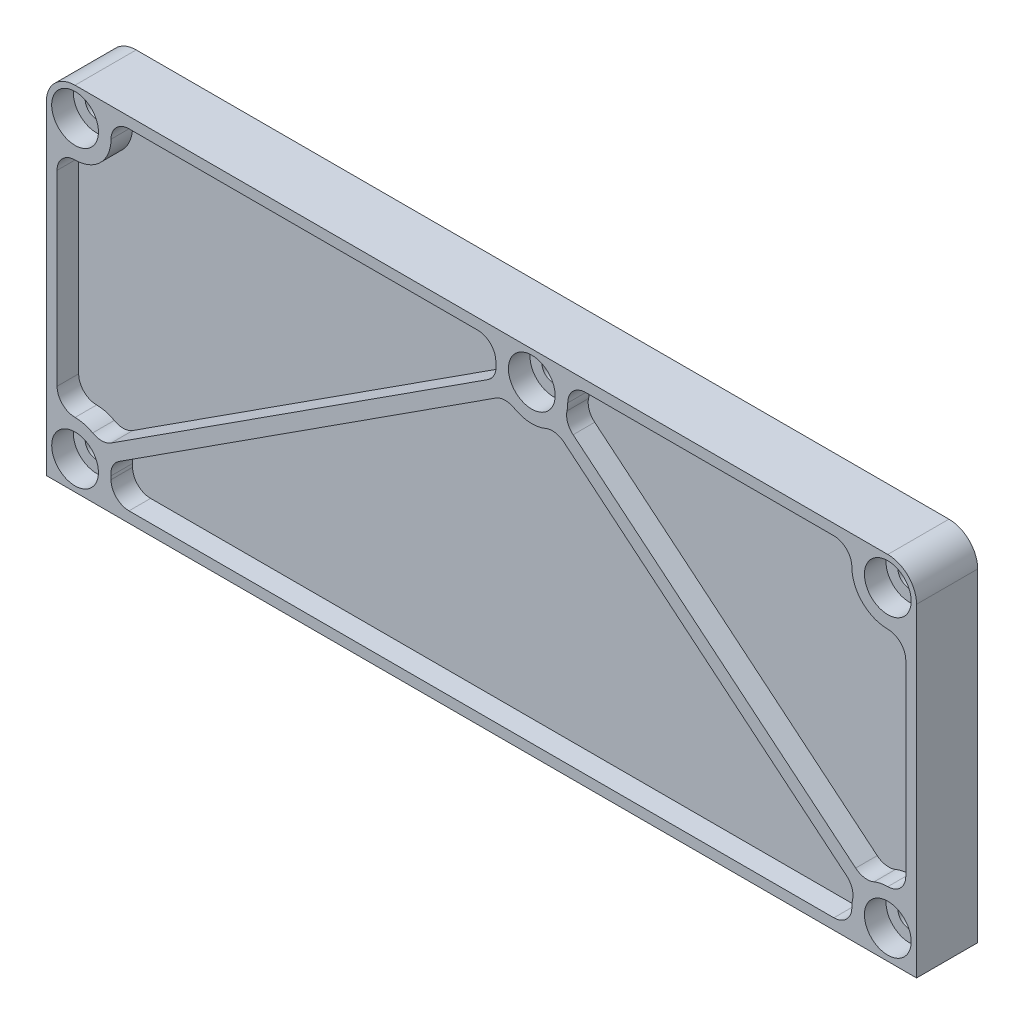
ISO-10303-21;
HEADER;
FILE_DESCRIPTION(('STEP AP214'),'2;1');
FILE_NAME('part.step','',(''),(''),'','','');
FILE_SCHEMA(('AUTOMOTIVE_DESIGN { 1 0 10303 214 1 1 1 1 }'));
ENDSEC;
DATA;
#1=APPLICATION_CONTEXT('core data for automotive mechanical design processes');
#2=APPLICATION_PROTOCOL_DEFINITION('international standard','automotive_design',2000,#1);
#3=PRODUCT_CONTEXT('',#1,'mechanical');
#4=PRODUCT('Part','Part','',(#3));
#5=PRODUCT_RELATED_PRODUCT_CATEGORY('part','',(#4));
#6=PRODUCT_DEFINITION_FORMATION('','',#4);
#7=PRODUCT_DEFINITION_CONTEXT('part definition',#1,'design');
#8=PRODUCT_DEFINITION('design','',#6,#7);
#9=PRODUCT_DEFINITION_SHAPE('','',#8);
#10=(LENGTH_UNIT() NAMED_UNIT(*) SI_UNIT(.MILLI.,.METRE.));
#11=(NAMED_UNIT(*) PLANE_ANGLE_UNIT() SI_UNIT($,.RADIAN.));
#12=(NAMED_UNIT(*) SI_UNIT($,.STERADIAN.) SOLID_ANGLE_UNIT());
#13=UNCERTAINTY_MEASURE_WITH_UNIT(LENGTH_MEASURE(1.E-05),#10,'distance_accuracy_value','');
#14=(GEOMETRIC_REPRESENTATION_CONTEXT(3) GLOBAL_UNCERTAINTY_ASSIGNED_CONTEXT((#13)) GLOBAL_UNIT_ASSIGNED_CONTEXT((#10,
#11,#12)) REPRESENTATION_CONTEXT('',''));
#15=CARTESIAN_POINT('',(0.,0.,0.));
#16=DIRECTION('',(0.,0.,1.));
#17=DIRECTION('',(1.,0.,0.));
#18=AXIS2_PLACEMENT_3D('',#15,#16,#17);
#19=CARTESIAN_POINT('',(60.5,24.5,5.5));
#20=DIRECTION('',(0.,0.,1.));
#21=DIRECTION('',(1.,0.,0.));
#22=AXIS2_PLACEMENT_3D('',#19,#20,#21);
#23=PLANE('',#22);
#24=DIRECTION('',(-1.,0.,0.));
#25=VECTOR('',#24,1.);
#26=CARTESIAN_POINT('',(112.,1.5,5.5));
#27=LINE('',#26,#25);
#28=CARTESIAN_POINT('',(109.5,1.5,5.5));
#29=VERTEX_POINT('',#28);
#30=CARTESIAN_POINT('',(11.5,1.49999999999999,5.5));
#31=VERTEX_POINT('',#30);
#32=EDGE_CURVE('E1169',#29,#31,#27,.T.);
#33=ORIENTED_EDGE('',*,*,#32,.F.);
#34=CARTESIAN_POINT('',(109.5,4.,5.50000000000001));
#35=DIRECTION('',(0.,0.,1.));
#36=DIRECTION('',(1.,0.,0.));
#37=AXIS2_PLACEMENT_3D('',#34,#35,#36);
#38=CIRCLE('',#37,2.5);
#39=CARTESIAN_POINT('',(112.,4.,5.5));
#40=VERTEX_POINT('',#39);
#41=EDGE_CURVE('E638',#29,#40,#38,.T.);
#42=ORIENTED_EDGE('',*,*,#41,.T.);
#43=CARTESIAN_POINT('',(117.,4.,5.5));
#44=DIRECTION('',(0.,0.,1.));
#45=DIRECTION('',(-1.,0.,0.));
#46=AXIS2_PLACEMENT_3D('',#43,#44,#45);
#47=CIRCLE('',#46,4.99999999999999);
#48=CARTESIAN_POINT('',(112.105952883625,5.02386660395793,5.5));
#49=VERTEX_POINT('',#48);
#50=EDGE_CURVE('E784',#49,#40,#47,.T.);
#51=ORIENTED_EDGE('',*,*,#50,.F.);
#52=CARTESIAN_POINT('',(109.658929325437,5.5357999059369,5.5));
#53=DIRECTION('',(0.,0.,1.));
#54=DIRECTION('',(1.,0.,0.));
#55=AXIS2_PLACEMENT_3D('',#52,#53,#54);
#56=CIRCLE('',#55,2.5);
#57=CARTESIAN_POINT('',(111.253644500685,7.46112676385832,5.5));
#58=VERTEX_POINT('',#57);
#59=EDGE_CURVE('E634',#49,#58,#56,.T.);
#60=ORIENTED_EDGE('',*,*,#59,.T.);
#61=DIRECTION('',(-0.77013074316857,0.637886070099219,0.));
#62=VECTOR('',#61,1.);
#63=CARTESIAN_POINT('',(112.589259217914,6.35486002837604,5.5));
#64=LINE('',#63,#62);
#65=CARTESIAN_POINT('',(71.9705833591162,39.9986117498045,5.5));
#66=VERTEX_POINT('',#65);
#67=EDGE_CURVE('E1161',#58,#66,#64,.T.);
#68=ORIENTED_EDGE('',*,*,#67,.T.);
#69=CARTESIAN_POINT('',(70.3758681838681,38.0732848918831,5.5));
#70=DIRECTION('',(0.,0.,1.));
#71=DIRECTION('',(1.,0.,0.));
#72=AXIS2_PLACEMENT_3D('',#69,#70,#71);
#73=CIRCLE('',#72,2.5);
#74=CARTESIAN_POINT('',(69.4172454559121,40.382189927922,5.5));
#75=VERTEX_POINT('',#74);
#76=EDGE_CURVE('E632',#66,#75,#73,.T.);
#77=ORIENTED_EDGE('',*,*,#76,.T.);
#78=CARTESIAN_POINT('',(67.5,45.,5.5));
#79=DIRECTION('',(0.,0.,1.));
#80=DIRECTION('',(1.,0.,0.));
#81=AXIS2_PLACEMENT_3D('',#78,#79,#80);
#82=CIRCLE('',#81,5.);
#83=CARTESIAN_POINT('',(65.0505941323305,40.6410539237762,5.5));
#84=VERTEX_POINT('',#83);
#85=EDGE_CURVE('E754',#84,#75,#82,.T.);
#86=ORIENTED_EDGE('',*,*,#85,.F.);
#87=CARTESIAN_POINT('',(63.8258911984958,38.4615808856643,5.5));
#88=DIRECTION('',(0.,0.,1.));
#89=DIRECTION('',(1.,0.,0.));
#90=AXIS2_PLACEMENT_3D('',#87,#88,#89);
#91=CIRCLE('',#90,2.5);
#92=CARTESIAN_POINT('',(62.4698207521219,40.5618363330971,5.5));
#93=VERTEX_POINT('',#92);
#94=EDGE_CURVE('E630',#84,#93,#91,.T.);
#95=ORIENTED_EDGE('',*,*,#94,.T.);
#96=DIRECTION('',(-0.840102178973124,-0.542428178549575,0.));
#97=VECTOR('',#96,1.);
#98=CARTESIAN_POINT('',(63.9267848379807,41.5025533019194,5.5));
#99=LINE('',#98,#97);
#100=CARTESIAN_POINT('',(10.1150356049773,6.75795930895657,5.5));
#101=VERTEX_POINT('',#100);
#102=EDGE_CURVE('E1150',#93,#101,#99,.T.);
#103=ORIENTED_EDGE('',*,*,#102,.T.);
#104=CARTESIAN_POINT('',(11.4711060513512,4.65770386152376,5.5));
#105=DIRECTION('',(0.,0.,1.));
#106=DIRECTION('',(1.,0.,0.));
#107=AXIS2_PLACEMENT_3D('',#104,#105,#106);
#108=CIRCLE('',#107,2.5);
#109=CARTESIAN_POINT('',(8.98073736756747,4.43846924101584,5.5));
#110=VERTEX_POINT('',#109);
#111=EDGE_CURVE('E628',#101,#110,#108,.T.);
#112=ORIENTED_EDGE('',*,*,#111,.T.);
#113=CARTESIAN_POINT('',(4.,4.,5.5));
#114=DIRECTION('',(0.,0.,1.));
#115=DIRECTION('',(1.,0.,0.));
#116=AXIS2_PLACEMENT_3D('',#113,#114,#115);
#117=CIRCLE('',#116,5.);
#118=CARTESIAN_POINT('',(9.,4.,5.5));
#119=VERTEX_POINT('',#118);
#120=EDGE_CURVE('E766',#119,#110,#117,.T.);
#121=ORIENTED_EDGE('',*,*,#120,.F.);
#122=CARTESIAN_POINT('',(11.5,3.99999999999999,5.5));
#123=DIRECTION('',(0.,0.,1.));
#124=DIRECTION('',(1.,0.,0.));
#125=AXIS2_PLACEMENT_3D('',#122,#123,#124);
#126=CIRCLE('',#125,2.5);
#127=EDGE_CURVE('E636',#119,#31,#126,.T.);
#128=ORIENTED_EDGE('',*,*,#127,.T.);
#129=EDGE_LOOP('',(#33,#42,#51,#60,#68,#77,#86,#95,#103,#112,#121,#128));
#130=FACE_BOUND('',#129,.T.);
#131=ADVANCED_FACE('F39',(#130),#23,.T.);
#132=CARTESIAN_POINT('',(67.5,45.,5.5));
#133=DIRECTION('',(0.,0.,1.));
#134=DIRECTION('',(1.,0.,0.));
#135=AXIS2_PLACEMENT_3D('',#132,#133,#134);
#136=CYLINDRICAL_SURFACE('',#135,5.);
#137=ORIENTED_EDGE('',*,*,#85,.T.);
#138=DIRECTION('',(0.,0.,1.));
#139=VECTOR('',#138,1.);
#140=CARTESIAN_POINT('',(69.4172454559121,40.382189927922,5.5));
#141=LINE('',#140,#139);
#142=CARTESIAN_POINT('',(69.4172454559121,40.382189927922,8.5));
#143=VERTEX_POINT('',#142);
#144=EDGE_CURVE('E681',#75,#143,#141,.T.);
#145=ORIENTED_EDGE('',*,*,#144,.T.);
#146=CARTESIAN_POINT('',(67.5,45.,8.5));
#147=DIRECTION('',(0.,0.,1.));
#148=DIRECTION('',(1.,0.,0.));
#149=AXIS2_PLACEMENT_3D('',#146,#147,#148);
#150=CIRCLE('',#149,5.);
#151=CARTESIAN_POINT('',(65.0505941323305,40.6410539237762,8.5));
#152=VERTEX_POINT('',#151);
#153=EDGE_CURVE('E759',#152,#143,#150,.T.);
#154=ORIENTED_EDGE('',*,*,#153,.F.);
#155=DIRECTION('',(0.,0.,1.));
#156=VECTOR('',#155,1.);
#157=CARTESIAN_POINT('',(65.0505941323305,40.6410539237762,5.5));
#158=LINE('',#157,#156);
#159=EDGE_CURVE('E679',#152,#84,#158,.F.);
#160=ORIENTED_EDGE('',*,*,#159,.T.);
#161=EDGE_LOOP('',(#137,#145,#154,#160));
#162=FACE_BOUND('',#161,.T.);
#163=ADVANCED_FACE('F893',(#162),#136,.T.);
#164=CARTESIAN_POINT('',(4.,4.,5.5));
#165=DIRECTION('',(0.,0.,1.));
#166=DIRECTION('',(1.,0.,0.));
#167=AXIS2_PLACEMENT_3D('',#164,#165,#166);
#168=CYLINDRICAL_SURFACE('',#167,5.);
#169=ORIENTED_EDGE('',*,*,#120,.T.);
#170=DIRECTION('',(0.,0.,1.));
#171=VECTOR('',#170,1.);
#172=CARTESIAN_POINT('',(8.98073736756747,4.43846924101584,5.5));
#173=LINE('',#172,#171);
#174=CARTESIAN_POINT('',(8.98073736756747,4.43846924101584,8.5));
#175=VERTEX_POINT('',#174);
#176=EDGE_CURVE('E697',#110,#175,#173,.T.);
#177=ORIENTED_EDGE('',*,*,#176,.T.);
#178=CARTESIAN_POINT('',(4.,4.,8.5));
#179=DIRECTION('',(0.,0.,1.));
#180=DIRECTION('',(1.,0.,0.));
#181=AXIS2_PLACEMENT_3D('',#178,#179,#180);
#182=CIRCLE('',#181,5.);
#183=CARTESIAN_POINT('',(9.,4.,8.5));
#184=VERTEX_POINT('',#183);
#185=EDGE_CURVE('E771',#184,#175,#182,.T.);
#186=ORIENTED_EDGE('',*,*,#185,.F.);
#187=DIRECTION('',(0.,0.,1.));
#188=VECTOR('',#187,1.);
#189=CARTESIAN_POINT('',(9.,4.,5.5));
#190=LINE('',#189,#188);
#191=EDGE_CURVE('E774',#119,#184,#190,.T.);
#192=ORIENTED_EDGE('',*,*,#191,.F.);
#193=EDGE_LOOP('',(#169,#177,#186,#192));
#194=FACE_BOUND('',#193,.T.);
#195=ADVANCED_FACE('F901',(#194),#168,.T.);
#196=DIRECTION('',(0.,1.,0.));
#197=VECTOR('',#196,1.);
#198=CARTESIAN_POINT('',(1.5,40.,5.5));
#199=LINE('',#198,#197);
#200=CARTESIAN_POINT('',(1.50000000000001,11.5,5.5));
#201=VERTEX_POINT('',#200);
#202=CARTESIAN_POINT('',(1.5,37.5,5.5));
#203=VERTEX_POINT('',#202);
#204=EDGE_CURVE('E935',#201,#203,#199,.T.);
#205=ORIENTED_EDGE('',*,*,#204,.F.);
#206=CARTESIAN_POINT('',(4.00000000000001,11.5,5.50000000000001));
#207=DIRECTION('',(0.,0.,1.));
#208=DIRECTION('',(1.,0.,0.));
#209=AXIS2_PLACEMENT_3D('',#206,#207,#208);
#210=CIRCLE('',#209,2.5);
#211=CARTESIAN_POINT('',(4.,9.,5.5));
#212=VERTEX_POINT('',#211);
#213=EDGE_CURVE('E655',#201,#212,#210,.T.);
#214=ORIENTED_EDGE('',*,*,#213,.T.);
#215=CARTESIAN_POINT('',(6.44940586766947,8.35894607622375,5.5));
#216=VERTEX_POINT('',#215);
#217=EDGE_CURVE('E770',#216,#212,#117,.T.);
#218=ORIENTED_EDGE('',*,*,#217,.F.);
#219=CARTESIAN_POINT('',(7.6741088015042,10.5384191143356,5.5));
#220=DIRECTION('',(0.,0.,1.));
#221=DIRECTION('',(1.,0.,0.));
#222=AXIS2_PLACEMENT_3D('',#219,#220,#221);
#223=CIRCLE('',#222,2.5);
#224=CARTESIAN_POINT('',(9.03017924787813,8.4381636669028,5.5));
#225=VERTEX_POINT('',#224);
#226=EDGE_CURVE('E645',#216,#225,#223,.T.);
#227=ORIENTED_EDGE('',*,*,#226,.T.);
#228=DIRECTION('',(0.840102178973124,0.542428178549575,0.));
#229=VECTOR('',#228,1.);
#230=CARTESIAN_POINT('',(62.8419284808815,43.1827576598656,5.5));
#231=LINE('',#230,#229);
#232=CARTESIAN_POINT('',(61.3849643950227,42.2420406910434,5.5));
#233=VERTEX_POINT('',#232);
#234=EDGE_CURVE('E1141',#225,#233,#231,.T.);
#235=ORIENTED_EDGE('',*,*,#234,.T.);
#236=CARTESIAN_POINT('',(60.0288939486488,44.3422961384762,5.5));
#237=DIRECTION('',(0.,0.,1.));
#238=DIRECTION('',(1.,0.,0.));
#239=AXIS2_PLACEMENT_3D('',#236,#237,#238);
#240=CIRCLE('',#239,2.5);
#241=CARTESIAN_POINT('',(62.5192626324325,44.5615307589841,5.5));
#242=VERTEX_POINT('',#241);
#243=EDGE_CURVE('E647',#233,#242,#240,.T.);
#244=ORIENTED_EDGE('',*,*,#243,.T.);
#245=CARTESIAN_POINT('',(62.5,45.,5.5));
#246=VERTEX_POINT('',#245);
#247=EDGE_CURVE('E750',#246,#242,#82,.T.);
#248=ORIENTED_EDGE('',*,*,#247,.F.);
#249=CARTESIAN_POINT('',(60.,45.,5.5));
#250=DIRECTION('',(0.,0.,1.));
#251=DIRECTION('',(1.,0.,0.));
#252=AXIS2_PLACEMENT_3D('',#249,#250,#251);
#253=CIRCLE('',#252,2.5);
#254=CARTESIAN_POINT('',(60.,47.5,5.5));
#255=VERTEX_POINT('',#254);
#256=EDGE_CURVE('E649',#246,#255,#253,.T.);
#257=ORIENTED_EDGE('',*,*,#256,.T.);
#258=DIRECTION('',(1.,0.,0.));
#259=VECTOR('',#258,1.);
#260=CARTESIAN_POINT('',(9.,47.5,5.5));
#261=LINE('',#260,#259);
#262=CARTESIAN_POINT('',(11.5,47.5,5.5));
#263=VERTEX_POINT('',#262);
#264=EDGE_CURVE('E942',#263,#255,#261,.T.);
#265=ORIENTED_EDGE('',*,*,#264,.F.);
#266=CARTESIAN_POINT('',(11.5,45.,5.50000000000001));
#267=DIRECTION('',(0.,0.,1.));
#268=DIRECTION('',(1.,0.,0.));
#269=AXIS2_PLACEMENT_3D('',#266,#267,#268);
#270=CIRCLE('',#269,2.5);
#271=CARTESIAN_POINT('',(9.,45.,5.5));
#272=VERTEX_POINT('',#271);
#273=EDGE_CURVE('E651',#263,#272,#270,.T.);
#274=ORIENTED_EDGE('',*,*,#273,.T.);
#275=CARTESIAN_POINT('',(4.,45.,5.5));
#276=DIRECTION('',(0.,0.,1.));
#277=DIRECTION('',(-1.,0.,0.));
#278=AXIS2_PLACEMENT_3D('',#275,#276,#277);
#279=CIRCLE('',#278,5.);
#280=CARTESIAN_POINT('',(4.,40.,5.5));
#281=VERTEX_POINT('',#280);
#282=EDGE_CURVE('E805',#281,#272,#279,.T.);
#283=ORIENTED_EDGE('',*,*,#282,.F.);
#284=CARTESIAN_POINT('',(4.,37.5,5.5));
#285=DIRECTION('',(0.,0.,1.));
#286=DIRECTION('',(1.,0.,0.));
#287=AXIS2_PLACEMENT_3D('',#284,#285,#286);
#288=CIRCLE('',#287,2.5);
#289=EDGE_CURVE('E653',#281,#203,#288,.T.);
#290=ORIENTED_EDGE('',*,*,#289,.T.);
#291=EDGE_LOOP('',(#205,#214,#218,#227,#235,#244,#248,#257,#265,#274,#283,#290));
#292=FACE_BOUND('',#291,.T.);
#293=ADVANCED_FACE('F896',(#292),#23,.T.);
#294=CARTESIAN_POINT('',(117.,4.,5.5));
#295=DIRECTION('',(0.,0.,1.));
#296=DIRECTION('',(1.,0.,0.));
#297=AXIS2_PLACEMENT_3D('',#294,#295,#296);
#298=CYLINDRICAL_SURFACE('',#297,4.99999999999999);
#299=CARTESIAN_POINT('',(117.,4.,8.5));
#300=DIRECTION('',(0.,0.,1.));
#301=DIRECTION('',(-1.,0.,0.));
#302=AXIS2_PLACEMENT_3D('',#299,#300,#301);
#303=CIRCLE('',#302,4.99999999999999);
#304=CARTESIAN_POINT('',(112.105952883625,5.02386660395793,8.5));
#305=VERTEX_POINT('',#304);
#306=CARTESIAN_POINT('',(112.,4.,8.5));
#307=VERTEX_POINT('',#306);
#308=EDGE_CURVE('E777',#305,#307,#303,.T.);
#309=ORIENTED_EDGE('',*,*,#308,.F.);
#310=DIRECTION('',(0.,0.,1.));
#311=VECTOR('',#310,1.);
#312=CARTESIAN_POINT('',(112.105952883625,5.02386660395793,5.5));
#313=LINE('',#312,#311);
#314=EDGE_CURVE('E675',#305,#49,#313,.F.);
#315=ORIENTED_EDGE('',*,*,#314,.T.);
#316=ORIENTED_EDGE('',*,*,#50,.T.);
#317=DIRECTION('',(0.,0.,1.));
#318=VECTOR('',#317,1.);
#319=CARTESIAN_POINT('',(112.,4.,5.5));
#320=LINE('',#319,#318);
#321=EDGE_CURVE('E783',#40,#307,#320,.T.);
#322=ORIENTED_EDGE('',*,*,#321,.T.);
#323=EDGE_LOOP('',(#309,#315,#316,#322));
#324=FACE_BOUND('',#323,.T.);
#325=ADVANCED_FACE('F910',(#324),#298,.T.);
#326=ORIENTED_EDGE('',*,*,#247,.T.);
#327=DIRECTION('',(0.,0.,1.));
#328=VECTOR('',#327,1.);
#329=CARTESIAN_POINT('',(62.5192626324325,44.5615307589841,5.5));
#330=LINE('',#329,#328);
#331=CARTESIAN_POINT('',(62.5192626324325,44.5615307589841,8.5));
#332=VERTEX_POINT('',#331);
#333=EDGE_CURVE('E689',#242,#332,#330,.T.);
#334=ORIENTED_EDGE('',*,*,#333,.T.);
#335=CARTESIAN_POINT('',(62.5,45.,8.5));
#336=VERTEX_POINT('',#335);
#337=EDGE_CURVE('E756',#336,#332,#150,.T.);
#338=ORIENTED_EDGE('',*,*,#337,.F.);
#339=DIRECTION('',(0.,0.,1.));
#340=VECTOR('',#339,1.);
#341=CARTESIAN_POINT('',(62.5,45.,5.5));
#342=LINE('',#341,#340);
#343=EDGE_CURVE('E753',#246,#336,#342,.T.);
#344=ORIENTED_EDGE('',*,*,#343,.F.);
#345=EDGE_LOOP('',(#326,#334,#338,#344));
#346=FACE_BOUND('',#345,.T.);
#347=ADVANCED_FACE('F904',(#346),#136,.T.);
#348=DIRECTION('',(0.,-1.,0.));
#349=VECTOR('',#348,1.);
#350=CARTESIAN_POINT('',(119.5,40.,5.5));
#351=LINE('',#350,#349);
#352=CARTESIAN_POINT('',(119.5,37.5,5.5));
#353=VERTEX_POINT('',#352);
#354=CARTESIAN_POINT('',(119.5,11.5,5.5));
#355=VERTEX_POINT('',#354);
#356=EDGE_CURVE('E923',#353,#355,#351,.T.);
#357=ORIENTED_EDGE('',*,*,#356,.F.);
#358=CARTESIAN_POINT('',(117.,37.5,5.50000000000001));
#359=DIRECTION('',(0.,0.,1.));
#360=DIRECTION('',(1.,0.,0.));
#361=AXIS2_PLACEMENT_3D('',#358,#359,#360);
#362=CIRCLE('',#361,2.5);
#363=CARTESIAN_POINT('',(117.,40.,5.5));
#364=VERTEX_POINT('',#363);
#365=EDGE_CURVE('E616',#353,#364,#362,.T.);
#366=ORIENTED_EDGE('',*,*,#365,.T.);
#367=CARTESIAN_POINT('',(117.,45.,5.5));
#368=DIRECTION('',(0.,0.,1.));
#369=DIRECTION('',(1.,0.,0.));
#370=AXIS2_PLACEMENT_3D('',#367,#368,#369);
#371=CIRCLE('',#370,4.99999999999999);
#372=CARTESIAN_POINT('',(112.,45.,5.5));
#373=VERTEX_POINT('',#372);
#374=EDGE_CURVE('E794',#373,#364,#371,.T.);
#375=ORIENTED_EDGE('',*,*,#374,.F.);
#376=CARTESIAN_POINT('',(109.5,45.,5.5));
#377=DIRECTION('',(0.,0.,1.));
#378=DIRECTION('',(1.,0.,0.));
#379=AXIS2_PLACEMENT_3D('',#376,#377,#378);
#380=CIRCLE('',#379,2.5);
#381=CARTESIAN_POINT('',(109.5,47.5,5.5));
#382=VERTEX_POINT('',#381);
#383=EDGE_CURVE('E614',#373,#382,#380,.T.);
#384=ORIENTED_EDGE('',*,*,#383,.T.);
#385=DIRECTION('',(1.,0.,0.));
#386=VECTOR('',#385,1.);
#387=CARTESIAN_POINT('',(72.5,47.5,5.5));
#388=LINE('',#387,#386);
#389=CARTESIAN_POINT('',(75.,47.5,5.5));
#390=VERTEX_POINT('',#389);
#391=EDGE_CURVE('E932',#390,#382,#388,.T.);
#392=ORIENTED_EDGE('',*,*,#391,.F.);
#393=CARTESIAN_POINT('',(75.,45.,5.50000000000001));
#394=DIRECTION('',(0.,0.,1.));
#395=DIRECTION('',(1.,0.,0.));
#396=AXIS2_PLACEMENT_3D('',#393,#394,#395);
#397=CIRCLE('',#396,2.5);
#398=CARTESIAN_POINT('',(72.5,45.,5.5));
#399=VERTEX_POINT('',#398);
#400=EDGE_CURVE('E610',#390,#399,#397,.T.);
#401=ORIENTED_EDGE('',*,*,#400,.T.);
#402=CARTESIAN_POINT('',(72.3940471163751,43.976133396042,5.5));
#403=VERTEX_POINT('',#402);
#404=EDGE_CURVE('E755',#403,#399,#82,.T.);
#405=ORIENTED_EDGE('',*,*,#404,.F.);
#406=CARTESIAN_POINT('',(74.8410706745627,43.464200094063,5.5));
#407=DIRECTION('',(0.,0.,1.));
#408=DIRECTION('',(1.,0.,0.));
#409=AXIS2_PLACEMENT_3D('',#406,#407,#408);
#410=CIRCLE('',#409,2.5);
#411=CARTESIAN_POINT('',(73.2463554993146,41.5388732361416,5.5));
#412=VERTEX_POINT('',#411);
#413=EDGE_CURVE('E606',#403,#412,#410,.T.);
#414=ORIENTED_EDGE('',*,*,#413,.T.);
#415=DIRECTION('',(0.77013074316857,-0.637886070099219,0.));
#416=VECTOR('',#415,1.);
#417=CARTESIAN_POINT('',(113.865031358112,7.89512151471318,5.5));
#418=LINE('',#417,#416);
#419=CARTESIAN_POINT('',(112.529416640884,9.00138825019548,5.5));
#420=VERTEX_POINT('',#419);
#421=EDGE_CURVE('E1163',#412,#420,#418,.T.);
#422=ORIENTED_EDGE('',*,*,#421,.T.);
#423=CARTESIAN_POINT('',(114.124131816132,10.9267151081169,5.5));
#424=DIRECTION('',(0.,0.,1.));
#425=DIRECTION('',(1.,0.,0.));
#426=AXIS2_PLACEMENT_3D('',#423,#424,#425);
#427=CIRCLE('',#426,2.5);
#428=CARTESIAN_POINT('',(115.082754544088,8.61781007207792,5.5));
#429=VERTEX_POINT('',#428);
#430=EDGE_CURVE('E608',#420,#429,#427,.T.);
#431=ORIENTED_EDGE('',*,*,#430,.T.);
#432=CARTESIAN_POINT('',(117.,9.,5.5));
#433=VERTEX_POINT('',#432);
#434=EDGE_CURVE('E780',#433,#429,#47,.T.);
#435=ORIENTED_EDGE('',*,*,#434,.F.);
#436=CARTESIAN_POINT('',(117.,11.5,5.5));
#437=DIRECTION('',(0.,0.,1.));
#438=DIRECTION('',(1.,0.,0.));
#439=AXIS2_PLACEMENT_3D('',#436,#437,#438);
#440=CIRCLE('',#439,2.5);
#441=EDGE_CURVE('E612',#433,#355,#440,.T.);
#442=ORIENTED_EDGE('',*,*,#441,.T.);
#443=EDGE_LOOP('',(#357,#366,#375,#384,#392,#401,#405,#414,#422,#431,#435,#442));
#444=FACE_BOUND('',#443,.T.);
#445=ADVANCED_FACE('F897',(#444),#23,.T.);
#446=CARTESIAN_POINT('',(0.,0.,4.));
#447=DIRECTION('',(0.,0.,-1.));
#448=DIRECTION('',(-1.,0.,0.));
#449=AXIS2_PLACEMENT_3D('',#446,#447,#448);
#450=PLANE('',#449);
#451=CARTESIAN_POINT('',(117.,4.,4.));
#452=DIRECTION('',(0.,0.,-1.));
#453=DIRECTION('',(-1.,0.,0.));
#454=AXIS2_PLACEMENT_3D('',#451,#452,#453);
#455=CIRCLE('',#454,4.99999999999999);
#456=CARTESIAN_POINT('',(112.,4.,4.));
#457=VERTEX_POINT('',#456);
#458=CARTESIAN_POINT('',(117.,9.,4.));
#459=VERTEX_POINT('',#458);
#460=EDGE_CURVE('E979',#457,#459,#455,.T.);
#461=ORIENTED_EDGE('',*,*,#460,.F.);
#462=CARTESIAN_POINT('',(109.5,4.,4.));
#463=DIRECTION('',(0.,0.,-1.));
#464=DIRECTION('',(-1.,0.,0.));
#465=AXIS2_PLACEMENT_3D('',#462,#463,#464);
#466=CIRCLE('',#465,2.5);
#467=CARTESIAN_POINT('',(109.5,1.5,4.));
#468=VERTEX_POINT('',#467);
#469=EDGE_CURVE('E577',#457,#468,#466,.T.);
#470=ORIENTED_EDGE('',*,*,#469,.T.);
#471=DIRECTION('',(-1.,0.,0.));
#472=VECTOR('',#471,1.);
#473=CARTESIAN_POINT('',(1.5,1.5,4.));
#474=LINE('',#473,#472);
#475=CARTESIAN_POINT('',(11.5,1.5,4.));
#476=VERTEX_POINT('',#475);
#477=EDGE_CURVE('E863',#468,#476,#474,.T.);
#478=ORIENTED_EDGE('',*,*,#477,.T.);
#479=CARTESIAN_POINT('',(11.5,4.,4.));
#480=DIRECTION('',(0.,0.,-1.));
#481=DIRECTION('',(-1.,0.,0.));
#482=AXIS2_PLACEMENT_3D('',#479,#480,#481);
#483=CIRCLE('',#482,2.5);
#484=CARTESIAN_POINT('',(9.,4.,4.));
#485=VERTEX_POINT('',#484);
#486=EDGE_CURVE('E573',#476,#485,#483,.T.);
#487=ORIENTED_EDGE('',*,*,#486,.T.);
#488=CARTESIAN_POINT('',(4.,4.,4.));
#489=DIRECTION('',(0.,0.,-1.));
#490=DIRECTION('',(-1.,0.,0.));
#491=AXIS2_PLACEMENT_3D('',#488,#489,#490);
#492=CIRCLE('',#491,5.);
#493=CARTESIAN_POINT('',(4.,9.,4.));
#494=VERTEX_POINT('',#493);
#495=EDGE_CURVE('E968',#494,#485,#492,.T.);
#496=ORIENTED_EDGE('',*,*,#495,.F.);
#497=CARTESIAN_POINT('',(4.,11.5,4.));
#498=DIRECTION('',(0.,0.,-1.));
#499=DIRECTION('',(-1.,0.,0.));
#500=AXIS2_PLACEMENT_3D('',#497,#498,#499);
#501=CIRCLE('',#500,2.5);
#502=CARTESIAN_POINT('',(1.5,11.5,4.));
#503=VERTEX_POINT('',#502);
#504=EDGE_CURVE('E571',#494,#503,#501,.T.);
#505=ORIENTED_EDGE('',*,*,#504,.T.);
#506=DIRECTION('',(0.,1.,0.));
#507=VECTOR('',#506,1.);
#508=CARTESIAN_POINT('',(1.5,1.5,4.));
#509=LINE('',#508,#507);
#510=CARTESIAN_POINT('',(1.5,37.5,4.));
#511=VERTEX_POINT('',#510);
#512=EDGE_CURVE('E725',#503,#511,#509,.T.);
#513=ORIENTED_EDGE('',*,*,#512,.T.);
#514=CARTESIAN_POINT('',(4.,37.5,4.));
#515=DIRECTION('',(0.,0.,-1.));
#516=DIRECTION('',(-1.,0.,0.));
#517=AXIS2_PLACEMENT_3D('',#514,#515,#516);
#518=CIRCLE('',#517,2.5);
#519=CARTESIAN_POINT('',(4.,40.,4.));
#520=VERTEX_POINT('',#519);
#521=EDGE_CURVE('E569',#511,#520,#518,.T.);
#522=ORIENTED_EDGE('',*,*,#521,.T.);
#523=CARTESIAN_POINT('',(4.,45.,4.));
#524=DIRECTION('',(0.,0.,-1.));
#525=DIRECTION('',(-1.,0.,0.));
#526=AXIS2_PLACEMENT_3D('',#523,#524,#525);
#527=CIRCLE('',#526,5.);
#528=CARTESIAN_POINT('',(9.,45.,4.));
#529=VERTEX_POINT('',#528);
#530=EDGE_CURVE('E734',#529,#520,#527,.T.);
#531=ORIENTED_EDGE('',*,*,#530,.F.);
#532=CARTESIAN_POINT('',(11.5,45.,4.));
#533=DIRECTION('',(0.,0.,-1.));
#534=DIRECTION('',(-1.,0.,0.));
#535=AXIS2_PLACEMENT_3D('',#532,#533,#534);
#536=CIRCLE('',#535,2.5);
#537=CARTESIAN_POINT('',(11.5,47.5,4.));
#538=VERTEX_POINT('',#537);
#539=EDGE_CURVE('E567',#529,#538,#536,.T.);
#540=ORIENTED_EDGE('',*,*,#539,.T.);
#541=DIRECTION('',(1.,0.,0.));
#542=VECTOR('',#541,1.);
#543=CARTESIAN_POINT('',(1.5,47.5,4.));
#544=LINE('',#543,#542);
#545=CARTESIAN_POINT('',(60.,47.5,4.));
#546=VERTEX_POINT('',#545);
#547=EDGE_CURVE('E550',#538,#546,#544,.T.);
#548=ORIENTED_EDGE('',*,*,#547,.T.);
#549=CARTESIAN_POINT('',(60.,45.,4.));
#550=DIRECTION('',(0.,0.,-1.));
#551=DIRECTION('',(-1.,0.,0.));
#552=AXIS2_PLACEMENT_3D('',#549,#550,#551);
#553=CIRCLE('',#552,2.5);
#554=CARTESIAN_POINT('',(62.5,45.,4.));
#555=VERTEX_POINT('',#554);
#556=EDGE_CURVE('E565',#546,#555,#553,.T.);
#557=ORIENTED_EDGE('',*,*,#556,.T.);
#558=CARTESIAN_POINT('',(67.5,45.,4.));
#559=DIRECTION('',(0.,0.,-1.));
#560=DIRECTION('',(-1.,0.,0.));
#561=AXIS2_PLACEMENT_3D('',#558,#559,#560);
#562=CIRCLE('',#561,5.);
#563=CARTESIAN_POINT('',(72.5,45.,4.));
#564=VERTEX_POINT('',#563);
#565=EDGE_CURVE('E438',#564,#555,#562,.T.);
#566=ORIENTED_EDGE('',*,*,#565,.F.);
#567=CARTESIAN_POINT('',(75.,45.,4.));
#568=DIRECTION('',(0.,0.,-1.));
#569=DIRECTION('',(-1.,0.,0.));
#570=AXIS2_PLACEMENT_3D('',#567,#568,#569);
#571=CIRCLE('',#570,2.5);
#572=CARTESIAN_POINT('',(75.,47.5,4.));
#573=VERTEX_POINT('',#572);
#574=EDGE_CURVE('E563',#564,#573,#571,.T.);
#575=ORIENTED_EDGE('',*,*,#574,.T.);
#576=CARTESIAN_POINT('',(109.5,47.5,4.));
#577=VERTEX_POINT('',#576);
#578=EDGE_CURVE('E549',#573,#577,#544,.T.);
#579=ORIENTED_EDGE('',*,*,#578,.T.);
#580=CARTESIAN_POINT('',(109.5,45.,4.));
#581=DIRECTION('',(0.,0.,-1.));
#582=DIRECTION('',(-1.,0.,0.));
#583=AXIS2_PLACEMENT_3D('',#580,#581,#582);
#584=CIRCLE('',#583,2.5);
#585=CARTESIAN_POINT('',(112.,45.,4.));
#586=VERTEX_POINT('',#585);
#587=EDGE_CURVE('E561',#577,#586,#584,.T.);
#588=ORIENTED_EDGE('',*,*,#587,.T.);
#589=CARTESIAN_POINT('',(117.,45.,4.));
#590=DIRECTION('',(0.,0.,-1.));
#591=DIRECTION('',(-1.,0.,0.));
#592=AXIS2_PLACEMENT_3D('',#589,#590,#591);
#593=CIRCLE('',#592,4.99999999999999);
#594=CARTESIAN_POINT('',(117.,40.,4.));
#595=VERTEX_POINT('',#594);
#596=EDGE_CURVE('E990',#595,#586,#593,.T.);
#597=ORIENTED_EDGE('',*,*,#596,.F.);
#598=CARTESIAN_POINT('',(117.,37.5,4.));
#599=DIRECTION('',(0.,0.,-1.));
#600=DIRECTION('',(-1.,0.,0.));
#601=AXIS2_PLACEMENT_3D('',#598,#599,#600);
#602=CIRCLE('',#601,2.5);
#603=CARTESIAN_POINT('',(119.5,37.5,4.));
#604=VERTEX_POINT('',#603);
#605=EDGE_CURVE('E559',#595,#604,#602,.T.);
#606=ORIENTED_EDGE('',*,*,#605,.T.);
#607=DIRECTION('',(0.,-1.,0.));
#608=VECTOR('',#607,1.);
#609=CARTESIAN_POINT('',(119.5,1.5,4.));
#610=LINE('',#609,#608);
#611=CARTESIAN_POINT('',(119.5,11.5,4.));
#612=VERTEX_POINT('',#611);
#613=EDGE_CURVE('E858',#604,#612,#610,.T.);
#614=ORIENTED_EDGE('',*,*,#613,.T.);
#615=CARTESIAN_POINT('',(117.,11.5,4.));
#616=DIRECTION('',(0.,0.,-1.));
#617=DIRECTION('',(-1.,0.,0.));
#618=AXIS2_PLACEMENT_3D('',#615,#616,#617);
#619=CIRCLE('',#618,2.5);
#620=EDGE_CURVE('E575',#612,#459,#619,.T.);
#621=ORIENTED_EDGE('',*,*,#620,.T.);
#622=EDGE_LOOP('',(#461,#470,#478,#487,#496,#505,#513,#522,#531,#540,#548,#557,#566,#575,#579,
#588,#597,#606,#614,#621));
#623=FACE_BOUND('',#622,.T.);
#624=ADVANCED_FACE('F733',(#623),#450,.T.);
#625=CARTESIAN_POINT('',(1.5,47.5,8.5));
#626=DIRECTION('',(0.,-1.,0.));
#627=DIRECTION('',(0.,0.,-1.));
#628=AXIS2_PLACEMENT_3D('',#625,#626,#627);
#629=PLANE('',#628);
#630=ORIENTED_EDGE('',*,*,#578,.F.);
#631=DIRECTION('',(0.,0.,-1.));
#632=VECTOR('',#631,1.);
#633=CARTESIAN_POINT('',(75.,47.5,8.5));
#634=LINE('',#633,#632);
#635=CARTESIAN_POINT('',(75.,47.5,0.));
#636=VERTEX_POINT('',#635);
#637=EDGE_CURVE('E598',#573,#636,#634,.T.);
#638=ORIENTED_EDGE('',*,*,#637,.T.);
#639=DIRECTION('',(-1.,0.,0.));
#640=VECTOR('',#639,1.);
#641=CARTESIAN_POINT('',(1.5,47.5,0.));
#642=LINE('',#641,#640);
#643=CARTESIAN_POINT('',(109.5,47.5,0.));
#644=VERTEX_POINT('',#643);
#645=EDGE_CURVE('E873',#644,#636,#642,.T.);
#646=ORIENTED_EDGE('',*,*,#645,.F.);
#647=DIRECTION('',(0.,0.,1.));
#648=VECTOR('',#647,1.);
#649=CARTESIAN_POINT('',(109.5,47.5,8.5));
#650=LINE('',#649,#648);
#651=EDGE_CURVE('E595',#644,#577,#650,.T.);
#652=ORIENTED_EDGE('',*,*,#651,.T.);
#653=EDGE_LOOP('',(#630,#638,#646,#652));
#654=FACE_BOUND('',#653,.T.);
#655=ADVANCED_FACE('F918',(#654),#629,.T.);
#656=ORIENTED_EDGE('',*,*,#547,.F.);
#657=DIRECTION('',(0.,0.,-1.));
#658=VECTOR('',#657,1.);
#659=CARTESIAN_POINT('',(11.5,47.5,8.5));
#660=LINE('',#659,#658);
#661=CARTESIAN_POINT('',(11.5,47.5,0.));
#662=VERTEX_POINT('',#661);
#663=EDGE_CURVE('E592',#538,#662,#660,.T.);
#664=ORIENTED_EDGE('',*,*,#663,.T.);
#665=CARTESIAN_POINT('',(60.,47.5,0.));
#666=VERTEX_POINT('',#665);
#667=EDGE_CURVE('E872',#666,#662,#642,.T.);
#668=ORIENTED_EDGE('',*,*,#667,.F.);
#669=DIRECTION('',(0.,0.,1.));
#670=VECTOR('',#669,1.);
#671=CARTESIAN_POINT('',(60.,47.5,8.5));
#672=LINE('',#671,#670);
#673=EDGE_CURVE('E455',#666,#546,#672,.T.);
#674=ORIENTED_EDGE('',*,*,#673,.T.);
#675=EDGE_LOOP('',(#656,#664,#668,#674));
#676=FACE_BOUND('',#675,.T.);
#677=ADVANCED_FACE('F1384',(#676),#629,.T.);
#678=CARTESIAN_POINT('',(1.5,1.5,8.5));
#679=DIRECTION('',(0.,1.,0.));
#680=DIRECTION('',(0.,0.,1.));
#681=AXIS2_PLACEMENT_3D('',#678,#679,#680);
#682=PLANE('',#681);
#683=ORIENTED_EDGE('',*,*,#477,.F.);
#684=DIRECTION('',(0.,0.,-1.));
#685=VECTOR('',#684,1.);
#686=CARTESIAN_POINT('',(109.5,1.5,8.5));
#687=LINE('',#686,#685);
#688=CARTESIAN_POINT('',(109.5,1.5,0.));
#689=VERTEX_POINT('',#688);
#690=EDGE_CURVE('E556',#468,#689,#687,.T.);
#691=ORIENTED_EDGE('',*,*,#690,.T.);
#692=DIRECTION('',(1.,0.,0.));
#693=VECTOR('',#692,1.);
#694=CARTESIAN_POINT('',(1.5,1.5,0.));
#695=LINE('',#694,#693);
#696=CARTESIAN_POINT('',(11.5,1.5,0.));
#697=VERTEX_POINT('',#696);
#698=EDGE_CURVE('E724',#697,#689,#695,.T.);
#699=ORIENTED_EDGE('',*,*,#698,.F.);
#700=DIRECTION('',(0.,0.,1.));
#701=VECTOR('',#700,1.);
#702=CARTESIAN_POINT('',(11.5,1.5,8.5));
#703=LINE('',#702,#701);
#704=EDGE_CURVE('E553',#697,#476,#703,.T.);
#705=ORIENTED_EDGE('',*,*,#704,.T.);
#706=EDGE_LOOP('',(#683,#691,#699,#705));
#707=FACE_BOUND('',#706,.T.);
#708=ADVANCED_FACE('F1022',(#707),#682,.T.);
#709=CARTESIAN_POINT('',(1.5,1.5,8.5));
#710=DIRECTION('',(1.,0.,0.));
#711=DIRECTION('',(0.,0.,-1.));
#712=AXIS2_PLACEMENT_3D('',#709,#710,#711);
#713=PLANE('',#712);
#714=ORIENTED_EDGE('',*,*,#512,.F.);
#715=DIRECTION('',(0.,0.,-1.));
#716=VECTOR('',#715,1.);
#717=CARTESIAN_POINT('',(1.5,11.5,8.5));
#718=LINE('',#717,#716);
#719=CARTESIAN_POINT('',(1.5,11.5,0.));
#720=VERTEX_POINT('',#719);
#721=EDGE_CURVE('E588',#503,#720,#718,.T.);
#722=ORIENTED_EDGE('',*,*,#721,.T.);
#723=DIRECTION('',(0.,-1.,0.));
#724=VECTOR('',#723,1.);
#725=CARTESIAN_POINT('',(1.5,1.5,0.));
#726=LINE('',#725,#724);
#727=CARTESIAN_POINT('',(1.5,37.5,0.));
#728=VERTEX_POINT('',#727);
#729=EDGE_CURVE('E713',#728,#720,#726,.T.);
#730=ORIENTED_EDGE('',*,*,#729,.F.);
#731=DIRECTION('',(0.,0.,1.));
#732=VECTOR('',#731,1.);
#733=CARTESIAN_POINT('',(1.5,37.5,8.5));
#734=LINE('',#733,#732);
#735=EDGE_CURVE('E585',#728,#511,#734,.T.);
#736=ORIENTED_EDGE('',*,*,#735,.T.);
#737=EDGE_LOOP('',(#714,#722,#730,#736));
#738=FACE_BOUND('',#737,.T.);
#739=ADVANCED_FACE('F721',(#738),#713,.T.);
#740=CARTESIAN_POINT('',(119.5,1.5,8.5));
#741=DIRECTION('',(-1.,0.,0.));
#742=DIRECTION('',(0.,0.,1.));
#743=AXIS2_PLACEMENT_3D('',#740,#741,#742);
#744=PLANE('',#743);
#745=DIRECTION('',(0.,1.,0.));
#746=VECTOR('',#745,1.);
#747=CARTESIAN_POINT('',(119.5,1.5,0.));
#748=LINE('',#747,#746);
#749=CARTESIAN_POINT('',(119.5,11.5,0.));
#750=VERTEX_POINT('',#749);
#751=CARTESIAN_POINT('',(119.5,37.5,0.));
#752=VERTEX_POINT('',#751);
#753=EDGE_CURVE('E869',#750,#752,#748,.T.);
#754=ORIENTED_EDGE('',*,*,#753,.F.);
#755=DIRECTION('',(0.,0.,1.));
#756=VECTOR('',#755,1.);
#757=CARTESIAN_POINT('',(119.5,11.5,8.5));
#758=LINE('',#757,#756);
#759=EDGE_CURVE('E582',#750,#612,#758,.T.);
#760=ORIENTED_EDGE('',*,*,#759,.T.);
#761=ORIENTED_EDGE('',*,*,#613,.F.);
#762=DIRECTION('',(0.,0.,-1.));
#763=VECTOR('',#762,1.);
#764=CARTESIAN_POINT('',(119.5,37.5,8.5));
#765=LINE('',#764,#763);
#766=EDGE_CURVE('E579',#604,#752,#765,.T.);
#767=ORIENTED_EDGE('',*,*,#766,.T.);
#768=EDGE_LOOP('',(#754,#760,#761,#767));
#769=FACE_BOUND('',#768,.T.);
#770=ADVANCED_FACE('F1007',(#769),#744,.T.);
#771=CARTESIAN_POINT('',(0.,0.,8.5));
#772=DIRECTION('',(0.,0.,-1.));
#773=DIRECTION('',(-1.,0.,0.));
#774=AXIS2_PLACEMENT_3D('',#771,#772,#773);
#775=PLANE('',#774);
#776=ORIENTED_EDGE('',*,*,#337,.T.);
#777=CARTESIAN_POINT('',(60.0288939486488,44.3422961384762,8.5));
#778=DIRECTION('',(0.,0.,-1.));
#779=DIRECTION('',(-1.,0.,0.));
#780=AXIS2_PLACEMENT_3D('',#777,#778,#779);
#781=CIRCLE('',#780,2.5);
#782=CARTESIAN_POINT('',(61.3849643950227,42.2420406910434,8.5));
#783=VERTEX_POINT('',#782);
#784=EDGE_CURVE('E497',#332,#783,#781,.T.);
#785=ORIENTED_EDGE('',*,*,#784,.T.);
#786=DIRECTION('',(-0.840102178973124,-0.542428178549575,0.));
#787=VECTOR('',#786,1.);
#788=CARTESIAN_POINT('',(62.8419284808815,43.1827576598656,8.5));
#789=LINE('',#788,#787);
#790=CARTESIAN_POINT('',(9.03017924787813,8.4381636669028,8.5));
#791=VERTEX_POINT('',#790);
#792=EDGE_CURVE('E1201',#783,#791,#789,.T.);
#793=ORIENTED_EDGE('',*,*,#792,.T.);
#794=CARTESIAN_POINT('',(7.6741088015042,10.5384191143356,8.5));
#795=DIRECTION('',(0.,0.,-1.));
#796=DIRECTION('',(-1.,0.,0.));
#797=AXIS2_PLACEMENT_3D('',#794,#795,#796);
#798=CIRCLE('',#797,2.5);
#799=CARTESIAN_POINT('',(6.44940586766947,8.35894607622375,8.5));
#800=VERTEX_POINT('',#799);
#801=EDGE_CURVE('E501',#791,#800,#798,.T.);
#802=ORIENTED_EDGE('',*,*,#801,.T.);
#803=CARTESIAN_POINT('',(4.,9.,8.5));
#804=VERTEX_POINT('',#803);
#805=EDGE_CURVE('E763',#800,#804,#182,.T.);
#806=ORIENTED_EDGE('',*,*,#805,.T.);
#807=CARTESIAN_POINT('',(4.00000000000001,11.5,8.50000000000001));
#808=DIRECTION('',(0.,0.,-1.));
#809=DIRECTION('',(-1.,0.,0.));
#810=AXIS2_PLACEMENT_3D('',#807,#808,#809);
#811=CIRCLE('',#810,2.5);
#812=CARTESIAN_POINT('',(1.50000000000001,11.5,8.50000000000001));
#813=VERTEX_POINT('',#812);
#814=EDGE_CURVE('E477',#804,#813,#811,.T.);
#815=ORIENTED_EDGE('',*,*,#814,.T.);
#816=DIRECTION('',(0.,-1.,0.));
#817=VECTOR('',#816,1.);
#818=CARTESIAN_POINT('',(1.5,40.,8.50000000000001));
#819=LINE('',#818,#817);
#820=CARTESIAN_POINT('',(1.5,37.5,8.50000000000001));
#821=VERTEX_POINT('',#820);
#822=EDGE_CURVE('E929',#821,#813,#819,.T.);
#823=ORIENTED_EDGE('',*,*,#822,.F.);
#824=CARTESIAN_POINT('',(4.,37.5,8.5));
#825=DIRECTION('',(0.,0.,-1.));
#826=DIRECTION('',(-1.,0.,0.));
#827=AXIS2_PLACEMENT_3D('',#824,#825,#826);
#828=CIRCLE('',#827,2.5);
#829=CARTESIAN_POINT('',(4.,40.,8.5));
#830=VERTEX_POINT('',#829);
#831=EDGE_CURVE('E479',#821,#830,#828,.T.);
#832=ORIENTED_EDGE('',*,*,#831,.T.);
#833=CARTESIAN_POINT('',(4.,45.,8.5));
#834=DIRECTION('',(0.,0.,1.));
#835=DIRECTION('',(-1.,0.,0.));
#836=AXIS2_PLACEMENT_3D('',#833,#834,#835);
#837=CIRCLE('',#836,5.);
#838=CARTESIAN_POINT('',(9.,45.,8.5));
#839=VERTEX_POINT('',#838);
#840=EDGE_CURVE('E803',#830,#839,#837,.T.);
#841=ORIENTED_EDGE('',*,*,#840,.T.);
#842=CARTESIAN_POINT('',(11.5,45.,8.50000000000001));
#843=DIRECTION('',(0.,0.,-1.));
#844=DIRECTION('',(-1.,0.,0.));
#845=AXIS2_PLACEMENT_3D('',#842,#843,#844);
#846=CIRCLE('',#845,2.5);
#847=CARTESIAN_POINT('',(11.5,47.5,8.50000000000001));
#848=VERTEX_POINT('',#847);
#849=EDGE_CURVE('E481',#839,#848,#846,.T.);
#850=ORIENTED_EDGE('',*,*,#849,.T.);
#851=DIRECTION('',(-1.,0.,0.));
#852=VECTOR('',#851,1.);
#853=CARTESIAN_POINT('',(9.,47.5,8.50000000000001));
#854=LINE('',#853,#852);
#855=CARTESIAN_POINT('',(60.,47.5,8.50000000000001));
#856=VERTEX_POINT('',#855);
#857=EDGE_CURVE('E945',#856,#848,#854,.T.);
#858=ORIENTED_EDGE('',*,*,#857,.F.);
#859=CARTESIAN_POINT('',(60.,45.,8.5));
#860=DIRECTION('',(0.,0.,-1.));
#861=DIRECTION('',(-1.,0.,0.));
#862=AXIS2_PLACEMENT_3D('',#859,#860,#861);
#863=CIRCLE('',#862,2.5);
#864=EDGE_CURVE('E485',#856,#336,#863,.T.);
#865=ORIENTED_EDGE('',*,*,#864,.T.);
#866=EDGE_LOOP('',(#776,#785,#793,#802,#806,#815,#823,#832,#841,#850,#858,#865));
#867=FACE_BOUND('',#866,.T.);
#868=CARTESIAN_POINT('',(117.,9.,8.5));
#869=VERTEX_POINT('',#868);
#870=CARTESIAN_POINT('',(115.082754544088,8.61781007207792,8.5));
#871=VERTEX_POINT('',#870);
#872=EDGE_CURVE('E785',#869,#871,#303,.T.);
#873=ORIENTED_EDGE('',*,*,#872,.T.);
#874=CARTESIAN_POINT('',(114.124131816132,10.9267151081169,8.5));
#875=DIRECTION('',(0.,0.,-1.));
#876=DIRECTION('',(-1.,0.,0.));
#877=AXIS2_PLACEMENT_3D('',#874,#875,#876);
#878=CIRCLE('',#877,2.5);
#879=CARTESIAN_POINT('',(112.529416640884,9.00138825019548,8.5));
#880=VERTEX_POINT('',#879);
#881=EDGE_CURVE('E487',#871,#880,#878,.T.);
#882=ORIENTED_EDGE('',*,*,#881,.T.);
#883=DIRECTION('',(-0.77013074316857,0.637886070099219,0.));
#884=VECTOR('',#883,1.);
#885=CARTESIAN_POINT('',(113.865031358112,7.89512151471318,8.5));
#886=LINE('',#885,#884);
#887=CARTESIAN_POINT('',(73.2463554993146,41.5388732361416,8.5));
#888=VERTEX_POINT('',#887);
#889=EDGE_CURVE('E1149',#880,#888,#886,.T.);
#890=ORIENTED_EDGE('',*,*,#889,.T.);
#891=CARTESIAN_POINT('',(74.8410706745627,43.464200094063,8.5));
#892=DIRECTION('',(0.,0.,-1.));
#893=DIRECTION('',(-1.,0.,0.));
#894=AXIS2_PLACEMENT_3D('',#891,#892,#893);
#895=CIRCLE('',#894,2.5);
#896=CARTESIAN_POINT('',(72.3940471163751,43.976133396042,8.5));
#897=VERTEX_POINT('',#896);
#898=EDGE_CURVE('E491',#888,#897,#895,.T.);
#899=ORIENTED_EDGE('',*,*,#898,.T.);
#900=CARTESIAN_POINT('',(72.5,45.,8.5));
#901=VERTEX_POINT('',#900);
#902=EDGE_CURVE('E748',#897,#901,#150,.T.);
#903=ORIENTED_EDGE('',*,*,#902,.T.);
#904=CARTESIAN_POINT('',(75.,45.,8.50000000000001));
#905=DIRECTION('',(0.,0.,-1.));
#906=DIRECTION('',(-1.,0.,0.));
#907=AXIS2_PLACEMENT_3D('',#904,#905,#906);
#908=CIRCLE('',#907,2.5);
#909=CARTESIAN_POINT('',(75.,47.5,8.50000000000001));
#910=VERTEX_POINT('',#909);
#911=EDGE_CURVE('E483',#901,#910,#908,.T.);
#912=ORIENTED_EDGE('',*,*,#911,.T.);
#913=DIRECTION('',(-1.,0.,0.));
#914=VECTOR('',#913,1.);
#915=CARTESIAN_POINT('',(72.5,47.5,8.50000000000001));
#916=LINE('',#915,#914);
#917=CARTESIAN_POINT('',(109.5,47.5,8.50000000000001));
#918=VERTEX_POINT('',#917);
#919=EDGE_CURVE('E939',#918,#910,#916,.T.);
#920=ORIENTED_EDGE('',*,*,#919,.F.);
#921=CARTESIAN_POINT('',(109.5,45.,8.5));
#922=DIRECTION('',(0.,0.,-1.));
#923=DIRECTION('',(-1.,0.,0.));
#924=AXIS2_PLACEMENT_3D('',#921,#922,#923);
#925=CIRCLE('',#924,2.5);
#926=CARTESIAN_POINT('',(112.,45.,8.5));
#927=VERTEX_POINT('',#926);
#928=EDGE_CURVE('E469',#918,#927,#925,.T.);
#929=ORIENTED_EDGE('',*,*,#928,.T.);
#930=CARTESIAN_POINT('',(117.,45.,8.5));
#931=DIRECTION('',(0.,0.,1.));
#932=DIRECTION('',(1.,0.,0.));
#933=AXIS2_PLACEMENT_3D('',#930,#931,#932);
#934=CIRCLE('',#933,4.99999999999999);
#935=CARTESIAN_POINT('',(117.,40.,8.5));
#936=VERTEX_POINT('',#935);
#937=EDGE_CURVE('E791',#927,#936,#934,.T.);
#938=ORIENTED_EDGE('',*,*,#937,.T.);
#939=CARTESIAN_POINT('',(117.,37.5,8.50000000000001));
#940=DIRECTION('',(0.,0.,-1.));
#941=DIRECTION('',(-1.,0.,0.));
#942=AXIS2_PLACEMENT_3D('',#939,#940,#941);
#943=CIRCLE('',#942,2.5);
#944=CARTESIAN_POINT('',(119.5,37.5,8.50000000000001));
#945=VERTEX_POINT('',#944);
#946=EDGE_CURVE('E467',#936,#945,#943,.T.);
#947=ORIENTED_EDGE('',*,*,#946,.T.);
#948=DIRECTION('',(0.,1.,0.));
#949=VECTOR('',#948,1.);
#950=CARTESIAN_POINT('',(119.5,40.,8.50000000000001));
#951=LINE('',#950,#949);
#952=CARTESIAN_POINT('',(119.5,11.5,8.50000000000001));
#953=VERTEX_POINT('',#952);
#954=EDGE_CURVE('E928',#953,#945,#951,.T.);
#955=ORIENTED_EDGE('',*,*,#954,.F.);
#956=CARTESIAN_POINT('',(117.,11.5,8.5));
#957=DIRECTION('',(0.,0.,-1.));
#958=DIRECTION('',(-1.,0.,0.));
#959=AXIS2_PLACEMENT_3D('',#956,#957,#958);
#960=CIRCLE('',#959,2.5);
#961=EDGE_CURVE('E471',#953,#869,#960,.T.);
#962=ORIENTED_EDGE('',*,*,#961,.T.);
#963=EDGE_LOOP('',(#873,#882,#890,#899,#903,#912,#920,#929,#938,#947,#955,#962));
#964=FACE_BOUND('',#963,.T.);
#965=DIRECTION('',(0.,1.,0.));
#966=VECTOR('',#965,1.);
#967=CARTESIAN_POINT('',(121.,0.,8.5));
#968=LINE('',#967,#966);
#969=CARTESIAN_POINT('',(121.,0.,8.5));
#970=VERTEX_POINT('',#969);
#971=CARTESIAN_POINT('',(121.,45.,8.5));
#972=VERTEX_POINT('',#971);
#973=EDGE_CURVE('E518',#970,#972,#968,.T.);
#974=ORIENTED_EDGE('',*,*,#973,.T.);
#975=CARTESIAN_POINT('',(117.,45.,8.5));
#976=DIRECTION('',(0.,0.,-1.));
#977=DIRECTION('',(-1.,0.,0.));
#978=AXIS2_PLACEMENT_3D('',#975,#976,#977);
#979=CIRCLE('',#978,4.);
#980=CARTESIAN_POINT('',(117.,49.,8.5));
#981=VERTEX_POINT('',#980);
#982=EDGE_CURVE('E47',#972,#981,#979,.F.);
#983=ORIENTED_EDGE('',*,*,#982,.T.);
#984=DIRECTION('',(-1.,0.,0.));
#985=VECTOR('',#984,1.);
#986=CARTESIAN_POINT('',(0.,49.,8.5));
#987=LINE('',#986,#985);
#988=CARTESIAN_POINT('',(4.,49.,8.5));
#989=VERTEX_POINT('',#988);
#990=EDGE_CURVE('E517',#981,#989,#987,.T.);
#991=ORIENTED_EDGE('',*,*,#990,.T.);
#992=CARTESIAN_POINT('',(4.,45.,8.5));
#993=DIRECTION('',(0.,0.,-1.));
#994=DIRECTION('',(-1.,0.,0.));
#995=AXIS2_PLACEMENT_3D('',#992,#993,#994);
#996=CIRCLE('',#995,4.);
#997=CARTESIAN_POINT('',(0.,45.,8.5));
#998=VERTEX_POINT('',#997);
#999=EDGE_CURVE('E54',#989,#998,#996,.F.);
#1000=ORIENTED_EDGE('',*,*,#999,.T.);
#1001=DIRECTION('',(0.,-1.,0.));
#1002=VECTOR('',#1001,1.);
#1003=CARTESIAN_POINT('',(0.,0.,8.5));
#1004=LINE('',#1003,#1002);
#1005=CARTESIAN_POINT('',(0.,0.,8.5));
#1006=VERTEX_POINT('',#1005);
#1007=EDGE_CURVE('E539',#998,#1006,#1004,.T.);
#1008=ORIENTED_EDGE('',*,*,#1007,.T.);
#1009=DIRECTION('',(1.,0.,0.));
#1010=VECTOR('',#1009,1.);
#1011=CARTESIAN_POINT('',(0.,0.,8.5));
#1012=LINE('',#1011,#1010);
#1013=EDGE_CURVE('E876',#1006,#970,#1012,.T.);
#1014=ORIENTED_EDGE('',*,*,#1013,.T.);
#1015=EDGE_LOOP('',(#974,#983,#991,#1000,#1008,#1014));
#1016=FACE_BOUND('',#1015,.T.);
#1017=CARTESIAN_POINT('',(67.5,45.,8.5));
#1018=DIRECTION('',(0.,0.,1.));
#1019=DIRECTION('',(1.,0.,0.));
#1020=AXIS2_PLACEMENT_3D('',#1017,#1018,#1019);
#1021=CIRCLE('',#1020,3.25000000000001);
#1022=CARTESIAN_POINT('',(70.75,45.,8.5));
#1023=VERTEX_POINT('',#1022);
#1024=EDGE_CURVE('E830',#1023,#1023,#1021,.T.);
#1025=ORIENTED_EDGE('',*,*,#1024,.F.);
#1026=EDGE_LOOP('',(#1025));
#1027=FACE_BOUND('',#1026,.T.);
#1028=ORIENTED_EDGE('',*,*,#153,.T.);
#1029=CARTESIAN_POINT('',(70.3758681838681,38.0732848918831,8.5));
#1030=DIRECTION('',(0.,0.,-1.));
#1031=DIRECTION('',(-1.,0.,0.));
#1032=AXIS2_PLACEMENT_3D('',#1029,#1030,#1031);
#1033=CIRCLE('',#1032,2.5);
#1034=CARTESIAN_POINT('',(71.9705833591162,39.9986117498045,8.5));
#1035=VERTEX_POINT('',#1034);
#1036=EDGE_CURVE('E493',#143,#1035,#1033,.T.);
#1037=ORIENTED_EDGE('',*,*,#1036,.T.);
#1038=DIRECTION('',(0.77013074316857,-0.637886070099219,0.));
#1039=VECTOR('',#1038,1.);
#1040=CARTESIAN_POINT('',(112.589259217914,6.35486002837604,8.5));
#1041=LINE('',#1040,#1039);
#1042=CARTESIAN_POINT('',(111.253644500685,7.46112676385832,8.5));
#1043=VERTEX_POINT('',#1042);
#1044=EDGE_CURVE('E1153',#1035,#1043,#1041,.T.);
#1045=ORIENTED_EDGE('',*,*,#1044,.T.);
#1046=CARTESIAN_POINT('',(109.658929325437,5.5357999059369,8.5));
#1047=DIRECTION('',(0.,0.,-1.));
#1048=DIRECTION('',(-1.,0.,0.));
#1049=AXIS2_PLACEMENT_3D('',#1046,#1047,#1048);
#1050=CIRCLE('',#1049,2.5);
#1051=EDGE_CURVE('E489',#1043,#305,#1050,.T.);
#1052=ORIENTED_EDGE('',*,*,#1051,.T.);
#1053=ORIENTED_EDGE('',*,*,#308,.T.);
#1054=CARTESIAN_POINT('',(109.5,4.,8.50000000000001));
#1055=DIRECTION('',(0.,0.,-1.));
#1056=DIRECTION('',(-1.,0.,0.));
#1057=AXIS2_PLACEMENT_3D('',#1054,#1055,#1056);
#1058=CIRCLE('',#1057,2.5);
#1059=CARTESIAN_POINT('',(109.5,1.5,8.50000000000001));
#1060=VERTEX_POINT('',#1059);
#1061=EDGE_CURVE('E473',#307,#1060,#1058,.T.);
#1062=ORIENTED_EDGE('',*,*,#1061,.T.);
#1063=DIRECTION('',(1.,0.,0.));
#1064=VECTOR('',#1063,1.);
#1065=CARTESIAN_POINT('',(112.,1.5,8.50000000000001));
#1066=LINE('',#1065,#1064);
#1067=CARTESIAN_POINT('',(11.5,1.49999999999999,8.50000000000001));
#1068=VERTEX_POINT('',#1067);
#1069=EDGE_CURVE('E1170',#1068,#1060,#1066,.T.);
#1070=ORIENTED_EDGE('',*,*,#1069,.F.);
#1071=CARTESIAN_POINT('',(11.5,3.99999999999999,8.5));
#1072=DIRECTION('',(0.,0.,-1.));
#1073=DIRECTION('',(-1.,0.,0.));
#1074=AXIS2_PLACEMENT_3D('',#1071,#1072,#1073);
#1075=CIRCLE('',#1074,2.5);
#1076=EDGE_CURVE('E475',#1068,#184,#1075,.T.);
#1077=ORIENTED_EDGE('',*,*,#1076,.T.);
#1078=ORIENTED_EDGE('',*,*,#185,.T.);
#1079=CARTESIAN_POINT('',(11.4711060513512,4.65770386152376,8.5));
#1080=DIRECTION('',(0.,0.,-1.));
#1081=DIRECTION('',(-1.,0.,0.));
#1082=AXIS2_PLACEMENT_3D('',#1079,#1080,#1081);
#1083=CIRCLE('',#1082,2.5);
#1084=CARTESIAN_POINT('',(10.1150356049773,6.75795930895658,8.5));
#1085=VERTEX_POINT('',#1084);
#1086=EDGE_CURVE('E499',#175,#1085,#1083,.T.);
#1087=ORIENTED_EDGE('',*,*,#1086,.T.);
#1088=DIRECTION('',(0.840102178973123,0.542428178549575,0.));
#1089=VECTOR('',#1088,1.);
#1090=CARTESIAN_POINT('',(63.9267848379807,41.5025533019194,8.5));
#1091=LINE('',#1090,#1089);
#1092=CARTESIAN_POINT('',(62.4698207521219,40.5618363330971,8.5));
#1093=VERTEX_POINT('',#1092);
#1094=EDGE_CURVE('E1156',#1085,#1093,#1091,.T.);
#1095=ORIENTED_EDGE('',*,*,#1094,.T.);
#1096=CARTESIAN_POINT('',(63.8258911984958,38.4615808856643,8.5));
#1097=DIRECTION('',(0.,0.,-1.));
#1098=DIRECTION('',(-1.,0.,0.));
#1099=AXIS2_PLACEMENT_3D('',#1096,#1097,#1098);
#1100=CIRCLE('',#1099,2.5);
#1101=EDGE_CURVE('E495',#1093,#152,#1100,.T.);
#1102=ORIENTED_EDGE('',*,*,#1101,.T.);
#1103=EDGE_LOOP('',(#1028,#1037,#1045,#1052,#1053,#1062,#1070,#1077,#1078,#1087,#1095,#1102));
#1104=FACE_BOUND('',#1103,.T.);
#1105=CARTESIAN_POINT('',(4.,45.,8.5));
#1106=DIRECTION('',(0.,0.,1.));
#1107=DIRECTION('',(1.,0.,0.));
#1108=AXIS2_PLACEMENT_3D('',#1105,#1106,#1107);
#1109=CIRCLE('',#1108,3.25);
#1110=CARTESIAN_POINT('',(7.25,45.,8.5));
#1111=VERTEX_POINT('',#1110);
#1112=EDGE_CURVE('E834',#1111,#1111,#1109,.T.);
#1113=ORIENTED_EDGE('',*,*,#1112,.F.);
#1114=EDGE_LOOP('',(#1113));
#1115=FACE_BOUND('',#1114,.T.);
#1116=CARTESIAN_POINT('',(117.,45.,8.5));
#1117=DIRECTION('',(0.,0.,1.));
#1118=DIRECTION('',(-1.,0.,0.));
#1119=AXIS2_PLACEMENT_3D('',#1116,#1117,#1118);
#1120=CIRCLE('',#1119,3.24999999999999);
#1121=CARTESIAN_POINT('',(113.75,45.,8.5));
#1122=VERTEX_POINT('',#1121);
#1123=EDGE_CURVE('E835',#1122,#1122,#1120,.T.);
#1124=ORIENTED_EDGE('',*,*,#1123,.F.);
#1125=EDGE_LOOP('',(#1124));
#1126=FACE_BOUND('',#1125,.T.);
#1127=CARTESIAN_POINT('',(117.,4.,8.5));
#1128=DIRECTION('',(0.,0.,1.));
#1129=DIRECTION('',(1.,0.,0.));
#1130=AXIS2_PLACEMENT_3D('',#1127,#1128,#1129);
#1131=CIRCLE('',#1130,3.24999999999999);
#1132=CARTESIAN_POINT('',(120.25,4.,8.5));
#1133=VERTEX_POINT('',#1132);
#1134=EDGE_CURVE('E841',#1133,#1133,#1131,.T.);
#1135=ORIENTED_EDGE('',*,*,#1134,.F.);
#1136=EDGE_LOOP('',(#1135));
#1137=FACE_BOUND('',#1136,.T.);
#1138=CARTESIAN_POINT('',(4.,4.,8.5));
#1139=DIRECTION('',(0.,0.,1.));
#1140=DIRECTION('',(-1.,0.,0.));
#1141=AXIS2_PLACEMENT_3D('',#1138,#1139,#1140);
#1142=CIRCLE('',#1141,3.25);
#1143=CARTESIAN_POINT('',(0.75,4.,8.5));
#1144=VERTEX_POINT('',#1143);
#1145=EDGE_CURVE('E847',#1144,#1144,#1142,.T.);
#1146=ORIENTED_EDGE('',*,*,#1145,.F.);
#1147=EDGE_LOOP('',(#1146));
#1148=FACE_BOUND('',#1147,.T.);
#1149=ADVANCED_FACE('F515',(#867,#964,#1016,#1027,#1104,#1115,#1126,#1137,#1148),#775,.F.);
#1150=CARTESIAN_POINT('',(0.,0.,8.5));
#1151=DIRECTION('',(0.,1.,0.));
#1152=DIRECTION('',(0.,0.,1.));
#1153=AXIS2_PLACEMENT_3D('',#1150,#1151,#1152);
#1154=PLANE('',#1153);
#1155=DIRECTION('',(0.,0.,-1.));
#1156=VECTOR('',#1155,1.);
#1157=CARTESIAN_POINT('',(121.,0.,8.5));
#1158=LINE('',#1157,#1156);
#1159=CARTESIAN_POINT('',(121.,0.,0.));
#1160=VERTEX_POINT('',#1159);
#1161=EDGE_CURVE('E526',#970,#1160,#1158,.T.);
#1162=ORIENTED_EDGE('',*,*,#1161,.F.);
#1163=ORIENTED_EDGE('',*,*,#1013,.F.);
#1164=DIRECTION('',(0.,0.,-1.));
#1165=VECTOR('',#1164,1.);
#1166=CARTESIAN_POINT('',(0.,0.,8.5));
#1167=LINE('',#1166,#1165);
#1168=CARTESIAN_POINT('',(0.,0.,0.));
#1169=VERTEX_POINT('',#1168);
#1170=EDGE_CURVE('E546',#1006,#1169,#1167,.T.);
#1171=ORIENTED_EDGE('',*,*,#1170,.T.);
#1172=DIRECTION('',(1.,0.,0.));
#1173=VECTOR('',#1172,1.);
#1174=CARTESIAN_POINT('',(0.,0.,0.));
#1175=LINE('',#1174,#1173);
#1176=EDGE_CURVE('E537',#1169,#1160,#1175,.T.);
#1177=ORIENTED_EDGE('',*,*,#1176,.T.);
#1178=EDGE_LOOP('',(#1162,#1163,#1171,#1177));
#1179=FACE_BOUND('',#1178,.T.);
#1180=ADVANCED_FACE('F885',(#1179),#1154,.F.);
#1181=CARTESIAN_POINT('',(121.,0.,8.5));
#1182=DIRECTION('',(-1.,0.,0.));
#1183=DIRECTION('',(0.,0.,1.));
#1184=AXIS2_PLACEMENT_3D('',#1181,#1182,#1183);
#1185=PLANE('',#1184);
#1186=DIRECTION('',(0.,1.,0.));
#1187=VECTOR('',#1186,1.);
#1188=CARTESIAN_POINT('',(121.,0.,0.));
#1189=LINE('',#1188,#1187);
#1190=CARTESIAN_POINT('',(121.,45.,0.));
#1191=VERTEX_POINT('',#1190);
#1192=EDGE_CURVE('E532',#1160,#1191,#1189,.T.);
#1193=ORIENTED_EDGE('',*,*,#1192,.T.);
#1194=DIRECTION('',(0.,0.,-1.));
#1195=VECTOR('',#1194,1.);
#1196=CARTESIAN_POINT('',(121.,45.,8.5));
#1197=LINE('',#1196,#1195);
#1198=EDGE_CURVE('E62',#1191,#972,#1197,.F.);
#1199=ORIENTED_EDGE('',*,*,#1198,.T.);
#1200=ORIENTED_EDGE('',*,*,#973,.F.);
#1201=ORIENTED_EDGE('',*,*,#1161,.T.);
#1202=EDGE_LOOP('',(#1193,#1199,#1200,#1201));
#1203=FACE_BOUND('',#1202,.T.);
#1204=ADVANCED_FACE('F535',(#1203),#1185,.F.);
#1205=CARTESIAN_POINT('',(0.,49.,8.5));
#1206=DIRECTION('',(0.,-1.,0.));
#1207=DIRECTION('',(0.,0.,-1.));
#1208=AXIS2_PLACEMENT_3D('',#1205,#1206,#1207);
#1209=PLANE('',#1208);
#1210=ORIENTED_EDGE('',*,*,#990,.F.);
#1211=DIRECTION('',(0.,0.,-1.));
#1212=VECTOR('',#1211,1.);
#1213=CARTESIAN_POINT('',(117.,49.,8.5));
#1214=LINE('',#1213,#1212);
#1215=CARTESIAN_POINT('',(117.,49.,0.));
#1216=VERTEX_POINT('',#1215);
#1217=EDGE_CURVE('E505',#981,#1216,#1214,.T.);
#1218=ORIENTED_EDGE('',*,*,#1217,.T.);
#1219=DIRECTION('',(-1.,0.,0.));
#1220=VECTOR('',#1219,1.);
#1221=CARTESIAN_POINT('',(0.,49.,0.));
#1222=LINE('',#1221,#1220);
#1223=CARTESIAN_POINT('',(4.,49.,0.));
#1224=VERTEX_POINT('',#1223);
#1225=EDGE_CURVE('E533',#1216,#1224,#1222,.T.);
#1226=ORIENTED_EDGE('',*,*,#1225,.T.);
#1227=DIRECTION('',(0.,0.,-1.));
#1228=VECTOR('',#1227,1.);
#1229=CARTESIAN_POINT('',(4.,49.,8.5));
#1230=LINE('',#1229,#1228);
#1231=EDGE_CURVE('E503',#1224,#989,#1230,.F.);
#1232=ORIENTED_EDGE('',*,*,#1231,.T.);
#1233=EDGE_LOOP('',(#1210,#1218,#1226,#1232));
#1234=FACE_BOUND('',#1233,.T.);
#1235=ADVANCED_FACE('F522',(#1234),#1209,.F.);
#1236=CARTESIAN_POINT('',(0.,0.,0.));
#1237=DIRECTION('',(0.,0.,-1.));
#1238=DIRECTION('',(-1.,0.,0.));
#1239=AXIS2_PLACEMENT_3D('',#1236,#1237,#1238);
#1240=PLANE('',#1239);
#1241=CARTESIAN_POINT('',(117.,45.,0.));
#1242=DIRECTION('',(0.,0.,1.));
#1243=DIRECTION('',(1.,0.,0.));
#1244=AXIS2_PLACEMENT_3D('',#1241,#1242,#1243);
#1245=CIRCLE('',#1244,1.60000000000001);
#1246=CARTESIAN_POINT('',(118.6,45.,0.));
#1247=VERTEX_POINT('',#1246);
#1248=EDGE_CURVE('E957',#1247,#1247,#1245,.T.);
#1249=ORIENTED_EDGE('',*,*,#1248,.T.);
#1250=EDGE_LOOP('',(#1249));
#1251=FACE_BOUND('',#1250,.T.);
#1252=CARTESIAN_POINT('',(4.,4.,0.));
#1253=DIRECTION('',(0.,0.,1.));
#1254=DIRECTION('',(1.,0.,0.));
#1255=AXIS2_PLACEMENT_3D('',#1252,#1253,#1254);
#1256=CIRCLE('',#1255,1.6);
#1257=CARTESIAN_POINT('',(5.6,4.,0.));
#1258=VERTEX_POINT('',#1257);
#1259=EDGE_CURVE('E954',#1258,#1258,#1256,.T.);
#1260=ORIENTED_EDGE('',*,*,#1259,.T.);
#1261=EDGE_LOOP('',(#1260));
#1262=FACE_BOUND('',#1261,.T.);
#1263=CARTESIAN_POINT('',(67.5,45.,0.));
#1264=DIRECTION('',(0.,0.,1.));
#1265=DIRECTION('',(1.,0.,0.));
#1266=AXIS2_PLACEMENT_3D('',#1263,#1264,#1265);
#1267=CIRCLE('',#1266,1.60000000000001);
#1268=CARTESIAN_POINT('',(69.1,45.,0.));
#1269=VERTEX_POINT('',#1268);
#1270=EDGE_CURVE('E951',#1269,#1269,#1267,.T.);
#1271=ORIENTED_EDGE('',*,*,#1270,.T.);
#1272=EDGE_LOOP('',(#1271));
#1273=FACE_BOUND('',#1272,.T.);
#1274=CARTESIAN_POINT('',(4.,45.,0.));
#1275=DIRECTION('',(0.,0.,1.));
#1276=DIRECTION('',(1.,0.,0.));
#1277=AXIS2_PLACEMENT_3D('',#1274,#1275,#1276);
#1278=CIRCLE('',#1277,1.6);
#1279=CARTESIAN_POINT('',(5.6,45.,0.));
#1280=VERTEX_POINT('',#1279);
#1281=EDGE_CURVE('E948',#1280,#1280,#1278,.T.);
#1282=ORIENTED_EDGE('',*,*,#1281,.T.);
#1283=EDGE_LOOP('',(#1282));
#1284=FACE_BOUND('',#1283,.T.);
#1285=CARTESIAN_POINT('',(117.,4.,0.));
#1286=DIRECTION('',(0.,0.,1.));
#1287=DIRECTION('',(1.,0.,0.));
#1288=AXIS2_PLACEMENT_3D('',#1285,#1286,#1287);
#1289=CIRCLE('',#1288,1.60000000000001);
#1290=CARTESIAN_POINT('',(118.6,4.,0.));
#1291=VERTEX_POINT('',#1290);
#1292=EDGE_CURVE('E960',#1291,#1291,#1289,.T.);
#1293=ORIENTED_EDGE('',*,*,#1292,.T.);
#1294=EDGE_LOOP('',(#1293));
#1295=FACE_BOUND('',#1294,.T.);
#1296=ORIENTED_EDGE('',*,*,#1225,.F.);
#1297=CARTESIAN_POINT('',(117.,45.,0.));
#1298=DIRECTION('',(0.,0.,-1.));
#1299=DIRECTION('',(-1.,0.,0.));
#1300=AXIS2_PLACEMENT_3D('',#1297,#1298,#1299);
#1301=CIRCLE('',#1300,4.);
#1302=EDGE_CURVE('E510',#1216,#1191,#1301,.T.);
#1303=ORIENTED_EDGE('',*,*,#1302,.T.);
#1304=ORIENTED_EDGE('',*,*,#1192,.F.);
#1305=ORIENTED_EDGE('',*,*,#1176,.F.);
#1306=DIRECTION('',(0.,-1.,0.));
#1307=VECTOR('',#1306,1.);
#1308=CARTESIAN_POINT('',(0.,0.,0.));
#1309=LINE('',#1308,#1307);
#1310=CARTESIAN_POINT('',(0.,45.,0.));
#1311=VERTEX_POINT('',#1310);
#1312=EDGE_CURVE('E541',#1311,#1169,#1309,.T.);
#1313=ORIENTED_EDGE('',*,*,#1312,.F.);
#1314=CARTESIAN_POINT('',(4.,45.,0.));
#1315=DIRECTION('',(0.,0.,-1.));
#1316=DIRECTION('',(-1.,0.,0.));
#1317=AXIS2_PLACEMENT_3D('',#1314,#1315,#1316);
#1318=CIRCLE('',#1317,4.);
#1319=EDGE_CURVE('E508',#1311,#1224,#1318,.T.);
#1320=ORIENTED_EDGE('',*,*,#1319,.T.);
#1321=EDGE_LOOP('',(#1296,#1303,#1304,#1305,#1313,#1320));
#1322=FACE_BOUND('',#1321,.T.);
#1323=CARTESIAN_POINT('',(117.,45.,0.));
#1324=DIRECTION('',(0.,0.,-1.));
#1325=DIRECTION('',(-1.,0.,0.));
#1326=AXIS2_PLACEMENT_3D('',#1323,#1324,#1325);
#1327=CIRCLE('',#1326,4.99999999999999);
#1328=CARTESIAN_POINT('',(117.,40.,0.));
#1329=VERTEX_POINT('',#1328);
#1330=CARTESIAN_POINT('',(112.,45.,0.));
#1331=VERTEX_POINT('',#1330);
#1332=EDGE_CURVE('E742',#1329,#1331,#1327,.T.);
#1333=ORIENTED_EDGE('',*,*,#1332,.T.);
#1334=CARTESIAN_POINT('',(109.5,45.,0.));
#1335=DIRECTION('',(0.,0.,-1.));
#1336=DIRECTION('',(-1.,0.,0.));
#1337=AXIS2_PLACEMENT_3D('',#1334,#1335,#1336);
#1338=CIRCLE('',#1337,2.5);
#1339=EDGE_CURVE('E458',#1331,#644,#1338,.F.);
#1340=ORIENTED_EDGE('',*,*,#1339,.T.);
#1341=ORIENTED_EDGE('',*,*,#645,.T.);
#1342=CARTESIAN_POINT('',(75.,45.,0.));
#1343=DIRECTION('',(0.,0.,-1.));
#1344=DIRECTION('',(-1.,0.,0.));
#1345=AXIS2_PLACEMENT_3D('',#1342,#1343,#1344);
#1346=CIRCLE('',#1345,2.5);
#1347=CARTESIAN_POINT('',(72.5,45.,0.));
#1348=VERTEX_POINT('',#1347);
#1349=EDGE_CURVE('E449',#636,#1348,#1346,.F.);
#1350=ORIENTED_EDGE('',*,*,#1349,.T.);
#1351=CARTESIAN_POINT('',(67.5,45.,0.));
#1352=DIRECTION('',(0.,0.,-1.));
#1353=DIRECTION('',(-1.,0.,0.));
#1354=AXIS2_PLACEMENT_3D('',#1351,#1352,#1353);
#1355=CIRCLE('',#1354,5.);
#1356=CARTESIAN_POINT('',(62.5,45.,0.));
#1357=VERTEX_POINT('',#1356);
#1358=EDGE_CURVE('E435',#1348,#1357,#1355,.T.);
#1359=ORIENTED_EDGE('',*,*,#1358,.T.);
#1360=CARTESIAN_POINT('',(60.,45.,0.));
#1361=DIRECTION('',(0.,0.,-1.));
#1362=DIRECTION('',(-1.,0.,0.));
#1363=AXIS2_PLACEMENT_3D('',#1360,#1361,#1362);
#1364=CIRCLE('',#1363,2.5);
#1365=EDGE_CURVE('E446',#1357,#666,#1364,.F.);
#1366=ORIENTED_EDGE('',*,*,#1365,.T.);
#1367=ORIENTED_EDGE('',*,*,#667,.T.);
#1368=CARTESIAN_POINT('',(11.5,45.,0.));
#1369=DIRECTION('',(0.,0.,-1.));
#1370=DIRECTION('',(-1.,0.,0.));
#1371=AXIS2_PLACEMENT_3D('',#1368,#1369,#1370);
#1372=CIRCLE('',#1371,2.5);
#1373=CARTESIAN_POINT('',(9.,45.,0.));
#1374=VERTEX_POINT('',#1373);
#1375=EDGE_CURVE('E456',#662,#1374,#1372,.F.);
#1376=ORIENTED_EDGE('',*,*,#1375,.T.);
#1377=CARTESIAN_POINT('',(4.,45.,0.));
#1378=DIRECTION('',(0.,0.,-1.));
#1379=DIRECTION('',(-1.,0.,0.));
#1380=AXIS2_PLACEMENT_3D('',#1377,#1378,#1379);
#1381=CIRCLE('',#1380,5.);
#1382=CARTESIAN_POINT('',(4.,40.,0.));
#1383=VERTEX_POINT('',#1382);
#1384=EDGE_CURVE('E715',#1374,#1383,#1381,.T.);
#1385=ORIENTED_EDGE('',*,*,#1384,.T.);
#1386=CARTESIAN_POINT('',(4.,37.5,0.));
#1387=DIRECTION('',(0.,0.,-1.));
#1388=DIRECTION('',(-1.,0.,0.));
#1389=AXIS2_PLACEMENT_3D('',#1386,#1387,#1388);
#1390=CIRCLE('',#1389,2.5);
#1391=EDGE_CURVE('E460',#1383,#728,#1390,.F.);
#1392=ORIENTED_EDGE('',*,*,#1391,.T.);
#1393=ORIENTED_EDGE('',*,*,#729,.T.);
#1394=CARTESIAN_POINT('',(4.,11.5,0.));
#1395=DIRECTION('',(0.,0.,-1.));
#1396=DIRECTION('',(-1.,0.,0.));
#1397=AXIS2_PLACEMENT_3D('',#1394,#1395,#1396);
#1398=CIRCLE('',#1397,2.5);
#1399=CARTESIAN_POINT('',(4.,9.,0.));
#1400=VERTEX_POINT('',#1399);
#1401=EDGE_CURVE('E708',#720,#1400,#1398,.F.);
#1402=ORIENTED_EDGE('',*,*,#1401,.T.);
#1403=CARTESIAN_POINT('',(4.,4.,0.));
#1404=DIRECTION('',(0.,0.,-1.));
#1405=DIRECTION('',(-1.,0.,0.));
#1406=AXIS2_PLACEMENT_3D('',#1403,#1404,#1405);
#1407=CIRCLE('',#1406,5.);
#1408=CARTESIAN_POINT('',(9.,4.,0.));
#1409=VERTEX_POINT('',#1408);
#1410=EDGE_CURVE('E972',#1400,#1409,#1407,.T.);
#1411=ORIENTED_EDGE('',*,*,#1410,.T.);
#1412=CARTESIAN_POINT('',(11.5,4.,0.));
#1413=DIRECTION('',(0.,0.,-1.));
#1414=DIRECTION('',(-1.,0.,0.));
#1415=AXIS2_PLACEMENT_3D('',#1412,#1413,#1414);
#1416=CIRCLE('',#1415,2.5);
#1417=EDGE_CURVE('E706',#1409,#697,#1416,.F.);
#1418=ORIENTED_EDGE('',*,*,#1417,.T.);
#1419=ORIENTED_EDGE('',*,*,#698,.T.);
#1420=CARTESIAN_POINT('',(109.5,4.,0.));
#1421=DIRECTION('',(0.,0.,-1.));
#1422=DIRECTION('',(-1.,0.,0.));
#1423=AXIS2_PLACEMENT_3D('',#1420,#1421,#1422);
#1424=CIRCLE('',#1423,2.5);
#1425=CARTESIAN_POINT('',(112.,4.,0.));
#1426=VERTEX_POINT('',#1425);
#1427=EDGE_CURVE('E702',#689,#1426,#1424,.F.);
#1428=ORIENTED_EDGE('',*,*,#1427,.T.);
#1429=CARTESIAN_POINT('',(117.,4.,0.));
#1430=DIRECTION('',(0.,0.,-1.));
#1431=DIRECTION('',(-1.,0.,0.));
#1432=AXIS2_PLACEMENT_3D('',#1429,#1430,#1431);
#1433=CIRCLE('',#1432,4.99999999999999);
#1434=CARTESIAN_POINT('',(117.,9.,0.));
#1435=VERTEX_POINT('',#1434);
#1436=EDGE_CURVE('E983',#1426,#1435,#1433,.T.);
#1437=ORIENTED_EDGE('',*,*,#1436,.T.);
#1438=CARTESIAN_POINT('',(117.,11.5,0.));
#1439=DIRECTION('',(0.,0.,-1.));
#1440=DIRECTION('',(-1.,0.,0.));
#1441=AXIS2_PLACEMENT_3D('',#1438,#1439,#1440);
#1442=CIRCLE('',#1441,2.5);
#1443=EDGE_CURVE('E704',#1435,#750,#1442,.F.);
#1444=ORIENTED_EDGE('',*,*,#1443,.T.);
#1445=ORIENTED_EDGE('',*,*,#753,.T.);
#1446=CARTESIAN_POINT('',(117.,37.5,0.));
#1447=DIRECTION('',(0.,0.,-1.));
#1448=DIRECTION('',(-1.,0.,0.));
#1449=AXIS2_PLACEMENT_3D('',#1446,#1447,#1448);
#1450=CIRCLE('',#1449,2.5);
#1451=EDGE_CURVE('E465',#752,#1329,#1450,.F.);
#1452=ORIENTED_EDGE('',*,*,#1451,.T.);
#1453=EDGE_LOOP('',(#1333,#1340,#1341,#1350,#1359,#1366,#1367,#1376,#1385,#1392,#1393,#1402,
#1411,#1418,#1419,#1428,#1437,#1444,#1445,#1452));
#1454=FACE_BOUND('',#1453,.T.);
#1455=ADVANCED_FACE('F444',(#1251,#1262,#1273,#1284,#1295,#1322,#1454),#1240,.T.);
#1456=CARTESIAN_POINT('',(0.,0.,8.5));
#1457=DIRECTION('',(1.,0.,0.));
#1458=DIRECTION('',(0.,0.,-1.));
#1459=AXIS2_PLACEMENT_3D('',#1456,#1457,#1458);
#1460=PLANE('',#1459);
#1461=ORIENTED_EDGE('',*,*,#1007,.F.);
#1462=DIRECTION('',(0.,0.,-1.));
#1463=VECTOR('',#1462,1.);
#1464=CARTESIAN_POINT('',(0.,45.,8.5));
#1465=LINE('',#1464,#1463);
#1466=EDGE_CURVE('E13',#998,#1311,#1465,.T.);
#1467=ORIENTED_EDGE('',*,*,#1466,.T.);
#1468=ORIENTED_EDGE('',*,*,#1312,.T.);
#1469=ORIENTED_EDGE('',*,*,#1170,.F.);
#1470=EDGE_LOOP('',(#1461,#1467,#1468,#1469));
#1471=FACE_BOUND('',#1470,.T.);
#1472=ADVANCED_FACE('F881',(#1471),#1460,.F.);
#1473=CARTESIAN_POINT('',(4.,45.,5.5));
#1474=DIRECTION('',(0.,0.,1.));
#1475=DIRECTION('',(1.,0.,0.));
#1476=AXIS2_PLACEMENT_3D('',#1473,#1474,#1475);
#1477=CYLINDRICAL_SURFACE('',#1476,3.25);
#1478=CARTESIAN_POINT('',(4.,45.,5.5));
#1479=DIRECTION('',(0.,0.,1.));
#1480=DIRECTION('',(1.,0.,0.));
#1481=AXIS2_PLACEMENT_3D('',#1478,#1479,#1480);
#1482=CIRCLE('',#1481,3.25);
#1483=CARTESIAN_POINT('',(7.25,45.,5.5));
#1484=VERTEX_POINT('',#1483);
#1485=EDGE_CURVE('E855',#1484,#1484,#1482,.T.);
#1486=ORIENTED_EDGE('',*,*,#1485,.F.);
#1487=EDGE_LOOP('',(#1486));
#1488=FACE_BOUND('',#1487,.T.);
#1489=ORIENTED_EDGE('',*,*,#1112,.T.);
#1490=EDGE_LOOP('',(#1489));
#1491=FACE_BOUND('',#1490,.T.);
#1492=ADVANCED_FACE('F1377',(#1488,#1491),#1477,.F.);
#1493=CARTESIAN_POINT('',(4.,45.,5.5));
#1494=DIRECTION('',(0.,0.,1.));
#1495=DIRECTION('',(1.,0.,0.));
#1496=AXIS2_PLACEMENT_3D('',#1493,#1494,#1495);
#1497=PLANE('',#1496);
#1498=CARTESIAN_POINT('',(4.,45.,5.5));
#1499=DIRECTION('',(0.,0.,1.));
#1500=DIRECTION('',(1.,0.,0.));
#1501=AXIS2_PLACEMENT_3D('',#1498,#1499,#1500);
#1502=CIRCLE('',#1501,1.6);
#1503=CARTESIAN_POINT('',(5.6,45.,5.5));
#1504=VERTEX_POINT('',#1503);
#1505=EDGE_CURVE('E819',#1504,#1504,#1502,.T.);
#1506=ORIENTED_EDGE('',*,*,#1505,.F.);
#1507=EDGE_LOOP('',(#1506));
#1508=FACE_BOUND('',#1507,.T.);
#1509=ORIENTED_EDGE('',*,*,#1485,.T.);
#1510=EDGE_LOOP('',(#1509));
#1511=FACE_BOUND('',#1510,.T.);
#1512=ADVANCED_FACE('F1351',(#1508,#1511),#1497,.T.);
#1513=CARTESIAN_POINT('',(117.,45.,5.5));
#1514=DIRECTION('',(0.,0.,1.));
#1515=DIRECTION('',(1.,0.,0.));
#1516=AXIS2_PLACEMENT_3D('',#1513,#1514,#1515);
#1517=CYLINDRICAL_SURFACE('',#1516,3.24999999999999);
#1518=CARTESIAN_POINT('',(117.,45.,5.5));
#1519=DIRECTION('',(0.,0.,1.));
#1520=DIRECTION('',(-1.,0.,0.));
#1521=AXIS2_PLACEMENT_3D('',#1518,#1519,#1520);
#1522=CIRCLE('',#1521,3.24999999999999);
#1523=CARTESIAN_POINT('',(113.75,45.,5.5));
#1524=VERTEX_POINT('',#1523);
#1525=EDGE_CURVE('E831',#1524,#1524,#1522,.T.);
#1526=ORIENTED_EDGE('',*,*,#1525,.F.);
#1527=EDGE_LOOP('',(#1526));
#1528=FACE_BOUND('',#1527,.T.);
#1529=ORIENTED_EDGE('',*,*,#1123,.T.);
#1530=EDGE_LOOP('',(#1529));
#1531=FACE_BOUND('',#1530,.T.);
#1532=ADVANCED_FACE('F1347',(#1528,#1531),#1517,.F.);
#1533=CARTESIAN_POINT('',(117.,45.,5.5));
#1534=DIRECTION('',(0.,0.,-1.));
#1535=DIRECTION('',(-1.,0.,0.));
#1536=AXIS2_PLACEMENT_3D('',#1533,#1534,#1535);
#1537=PLANE('',#1536);
#1538=CARTESIAN_POINT('',(117.,45.,5.5));
#1539=DIRECTION('',(0.,0.,1.));
#1540=DIRECTION('',(1.,0.,0.));
#1541=AXIS2_PLACEMENT_3D('',#1538,#1539,#1540);
#1542=CIRCLE('',#1541,1.60000000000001);
#1543=CARTESIAN_POINT('',(118.6,45.,5.5));
#1544=VERTEX_POINT('',#1543);
#1545=EDGE_CURVE('E820',#1544,#1544,#1542,.T.);
#1546=ORIENTED_EDGE('',*,*,#1545,.F.);
#1547=EDGE_LOOP('',(#1546));
#1548=FACE_BOUND('',#1547,.T.);
#1549=ORIENTED_EDGE('',*,*,#1525,.T.);
#1550=EDGE_LOOP('',(#1549));
#1551=FACE_BOUND('',#1550,.T.);
#1552=ADVANCED_FACE('F1343',(#1548,#1551),#1537,.F.);
#1553=CARTESIAN_POINT('',(117.,4.,5.5));
#1554=DIRECTION('',(0.,0.,1.));
#1555=DIRECTION('',(1.,0.,0.));
#1556=AXIS2_PLACEMENT_3D('',#1553,#1554,#1555);
#1557=CYLINDRICAL_SURFACE('',#1556,3.24999999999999);
#1558=CARTESIAN_POINT('',(117.,4.,5.5));
#1559=DIRECTION('',(0.,0.,1.));
#1560=DIRECTION('',(1.,0.,0.));
#1561=AXIS2_PLACEMENT_3D('',#1558,#1559,#1560);
#1562=CIRCLE('',#1561,3.24999999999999);
#1563=CARTESIAN_POINT('',(120.25,4.,5.5));
#1564=VERTEX_POINT('',#1563);
#1565=EDGE_CURVE('E838',#1564,#1564,#1562,.T.);
#1566=ORIENTED_EDGE('',*,*,#1565,.F.);
#1567=EDGE_LOOP('',(#1566));
#1568=FACE_BOUND('',#1567,.T.);
#1569=ORIENTED_EDGE('',*,*,#1134,.T.);
#1570=EDGE_LOOP('',(#1569));
#1571=FACE_BOUND('',#1570,.T.);
#1572=ADVANCED_FACE('F1346',(#1568,#1571),#1557,.F.);
#1573=CARTESIAN_POINT('',(117.,4.,5.5));
#1574=DIRECTION('',(0.,0.,1.));
#1575=DIRECTION('',(1.,0.,0.));
#1576=AXIS2_PLACEMENT_3D('',#1573,#1574,#1575);
#1577=PLANE('',#1576);
#1578=CARTESIAN_POINT('',(117.,4.,5.5));
#1579=DIRECTION('',(0.,0.,1.));
#1580=DIRECTION('',(1.,0.,0.));
#1581=AXIS2_PLACEMENT_3D('',#1578,#1579,#1580);
#1582=CIRCLE('',#1581,1.60000000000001);
#1583=CARTESIAN_POINT('',(118.6,4.,5.5));
#1584=VERTEX_POINT('',#1583);
#1585=EDGE_CURVE('E823',#1584,#1584,#1582,.T.);
#1586=ORIENTED_EDGE('',*,*,#1585,.F.);
#1587=EDGE_LOOP('',(#1586));
#1588=FACE_BOUND('',#1587,.T.);
#1589=ORIENTED_EDGE('',*,*,#1565,.T.);
#1590=EDGE_LOOP('',(#1589));
#1591=FACE_BOUND('',#1590,.T.);
#1592=ADVANCED_FACE('F1353',(#1588,#1591),#1577,.T.);
#1593=CARTESIAN_POINT('',(4.,4.,5.5));
#1594=DIRECTION('',(0.,0.,1.));
#1595=DIRECTION('',(1.,0.,0.));
#1596=AXIS2_PLACEMENT_3D('',#1593,#1594,#1595);
#1597=CYLINDRICAL_SURFACE('',#1596,3.25);
#1598=CARTESIAN_POINT('',(4.,4.,5.5));
#1599=DIRECTION('',(0.,0.,1.));
#1600=DIRECTION('',(-1.,0.,0.));
#1601=AXIS2_PLACEMENT_3D('',#1598,#1599,#1600);
#1602=CIRCLE('',#1601,3.25);
#1603=CARTESIAN_POINT('',(0.75,4.,5.5));
#1604=VERTEX_POINT('',#1603);
#1605=EDGE_CURVE('E844',#1604,#1604,#1602,.T.);
#1606=ORIENTED_EDGE('',*,*,#1605,.F.);
#1607=EDGE_LOOP('',(#1606));
#1608=FACE_BOUND('',#1607,.T.);
#1609=ORIENTED_EDGE('',*,*,#1145,.T.);
#1610=EDGE_LOOP('',(#1609));
#1611=FACE_BOUND('',#1610,.T.);
#1612=ADVANCED_FACE('F1356',(#1608,#1611),#1597,.F.);
#1613=CARTESIAN_POINT('',(4.,4.,5.5));
#1614=DIRECTION('',(0.,0.,-1.));
#1615=DIRECTION('',(-1.,0.,0.));
#1616=AXIS2_PLACEMENT_3D('',#1613,#1614,#1615);
#1617=PLANE('',#1616);
#1618=CARTESIAN_POINT('',(4.,4.,5.5));
#1619=DIRECTION('',(0.,0.,1.));
#1620=DIRECTION('',(1.,0.,0.));
#1621=AXIS2_PLACEMENT_3D('',#1618,#1619,#1620);
#1622=CIRCLE('',#1621,1.6);
#1623=CARTESIAN_POINT('',(5.6,4.,5.5));
#1624=VERTEX_POINT('',#1623);
#1625=EDGE_CURVE('E813',#1624,#1624,#1622,.T.);
#1626=ORIENTED_EDGE('',*,*,#1625,.F.);
#1627=EDGE_LOOP('',(#1626));
#1628=FACE_BOUND('',#1627,.T.);
#1629=ORIENTED_EDGE('',*,*,#1605,.T.);
#1630=EDGE_LOOP('',(#1629));
#1631=FACE_BOUND('',#1630,.T.);
#1632=ADVANCED_FACE('F1361',(#1628,#1631),#1617,.F.);
#1633=CARTESIAN_POINT('',(67.5,45.,5.5));
#1634=DIRECTION('',(0.,0.,1.));
#1635=DIRECTION('',(1.,0.,0.));
#1636=AXIS2_PLACEMENT_3D('',#1633,#1634,#1635);
#1637=CYLINDRICAL_SURFACE('',#1636,3.25000000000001);
#1638=CARTESIAN_POINT('',(67.5,45.,5.5));
#1639=DIRECTION('',(0.,0.,1.));
#1640=DIRECTION('',(1.,0.,0.));
#1641=AXIS2_PLACEMENT_3D('',#1638,#1639,#1640);
#1642=CIRCLE('',#1641,3.25000000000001);
#1643=CARTESIAN_POINT('',(70.75,45.,5.5));
#1644=VERTEX_POINT('',#1643);
#1645=EDGE_CURVE('E850',#1644,#1644,#1642,.T.);
#1646=ORIENTED_EDGE('',*,*,#1645,.F.);
#1647=EDGE_LOOP('',(#1646));
#1648=FACE_BOUND('',#1647,.T.);
#1649=ORIENTED_EDGE('',*,*,#1024,.T.);
#1650=EDGE_LOOP('',(#1649));
#1651=FACE_BOUND('',#1650,.T.);
#1652=ADVANCED_FACE('F1364',(#1648,#1651),#1637,.F.);
#1653=CARTESIAN_POINT('',(67.5,45.,5.5));
#1654=DIRECTION('',(0.,0.,1.));
#1655=DIRECTION('',(1.,0.,0.));
#1656=AXIS2_PLACEMENT_3D('',#1653,#1654,#1655);
#1657=PLANE('',#1656);
#1658=CARTESIAN_POINT('',(67.5,45.,5.5));
#1659=DIRECTION('',(0.,0.,1.));
#1660=DIRECTION('',(1.,0.,0.));
#1661=AXIS2_PLACEMENT_3D('',#1658,#1659,#1660);
#1662=CIRCLE('',#1661,1.60000000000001);
#1663=CARTESIAN_POINT('',(69.1,45.,5.5));
#1664=VERTEX_POINT('',#1663);
#1665=EDGE_CURVE('E816',#1664,#1664,#1662,.T.);
#1666=ORIENTED_EDGE('',*,*,#1665,.F.);
#1667=EDGE_LOOP('',(#1666));
#1668=FACE_BOUND('',#1667,.T.);
#1669=ORIENTED_EDGE('',*,*,#1645,.T.);
#1670=EDGE_LOOP('',(#1669));
#1671=FACE_BOUND('',#1670,.T.);
#1672=ADVANCED_FACE('F1341',(#1668,#1671),#1657,.T.);
#1673=CARTESIAN_POINT('',(4.,45.,0.));
#1674=DIRECTION('',(0.,0.,1.));
#1675=DIRECTION('',(1.,0.,0.));
#1676=AXIS2_PLACEMENT_3D('',#1673,#1674,#1675);
#1677=CYLINDRICAL_SURFACE('',#1676,1.6);
#1678=ORIENTED_EDGE('',*,*,#1505,.T.);
#1679=EDGE_LOOP('',(#1678));
#1680=FACE_BOUND('',#1679,.T.);
#1681=ORIENTED_EDGE('',*,*,#1281,.F.);
#1682=EDGE_LOOP('',(#1681));
#1683=FACE_BOUND('',#1682,.T.);
#1684=ADVANCED_FACE('F1337',(#1680,#1683),#1677,.F.);
#1685=CARTESIAN_POINT('',(67.5,45.,0.));
#1686=DIRECTION('',(0.,0.,1.));
#1687=DIRECTION('',(1.,0.,0.));
#1688=AXIS2_PLACEMENT_3D('',#1685,#1686,#1687);
#1689=CYLINDRICAL_SURFACE('',#1688,1.60000000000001);
#1690=ORIENTED_EDGE('',*,*,#1665,.T.);
#1691=EDGE_LOOP('',(#1690));
#1692=FACE_BOUND('',#1691,.T.);
#1693=ORIENTED_EDGE('',*,*,#1270,.F.);
#1694=EDGE_LOOP('',(#1693));
#1695=FACE_BOUND('',#1694,.T.);
#1696=ADVANCED_FACE('F1340',(#1692,#1695),#1689,.F.);
#1697=CARTESIAN_POINT('',(117.,45.,0.));
#1698=DIRECTION('',(0.,0.,1.));
#1699=DIRECTION('',(1.,0.,0.));
#1700=AXIS2_PLACEMENT_3D('',#1697,#1698,#1699);
#1701=CYLINDRICAL_SURFACE('',#1700,1.60000000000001);
#1702=ORIENTED_EDGE('',*,*,#1545,.T.);
#1703=EDGE_LOOP('',(#1702));
#1704=FACE_BOUND('',#1703,.T.);
#1705=ORIENTED_EDGE('',*,*,#1248,.F.);
#1706=EDGE_LOOP('',(#1705));
#1707=FACE_BOUND('',#1706,.T.);
#1708=ADVANCED_FACE('F1331',(#1704,#1707),#1701,.F.);
#1709=CARTESIAN_POINT('',(117.,4.,0.));
#1710=DIRECTION('',(0.,0.,1.));
#1711=DIRECTION('',(1.,0.,0.));
#1712=AXIS2_PLACEMENT_3D('',#1709,#1710,#1711);
#1713=CYLINDRICAL_SURFACE('',#1712,1.60000000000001);
#1714=ORIENTED_EDGE('',*,*,#1585,.T.);
#1715=EDGE_LOOP('',(#1714));
#1716=FACE_BOUND('',#1715,.T.);
#1717=ORIENTED_EDGE('',*,*,#1292,.F.);
#1718=EDGE_LOOP('',(#1717));
#1719=FACE_BOUND('',#1718,.T.);
#1720=ADVANCED_FACE('F1325',(#1716,#1719),#1713,.F.);
#1721=CARTESIAN_POINT('',(4.,4.,0.));
#1722=DIRECTION('',(0.,0.,1.));
#1723=DIRECTION('',(1.,0.,0.));
#1724=AXIS2_PLACEMENT_3D('',#1721,#1722,#1723);
#1725=CYLINDRICAL_SURFACE('',#1724,1.6);
#1726=ORIENTED_EDGE('',*,*,#1625,.T.);
#1727=EDGE_LOOP('',(#1726));
#1728=FACE_BOUND('',#1727,.T.);
#1729=ORIENTED_EDGE('',*,*,#1259,.F.);
#1730=EDGE_LOOP('',(#1729));
#1731=FACE_BOUND('',#1730,.T.);
#1732=ADVANCED_FACE('F1321',(#1728,#1731),#1725,.F.);
#1733=CARTESIAN_POINT('',(4.,45.,5.5));
#1734=DIRECTION('',(0.,0.,1.));
#1735=DIRECTION('',(1.,0.,0.));
#1736=AXIS2_PLACEMENT_3D('',#1733,#1734,#1735);
#1737=CYLINDRICAL_SURFACE('',#1736,5.);
#1738=ORIENTED_EDGE('',*,*,#840,.F.);
#1739=DIRECTION('',(0.,0.,1.));
#1740=VECTOR('',#1739,1.);
#1741=CARTESIAN_POINT('',(4.,40.,5.5));
#1742=LINE('',#1741,#1740);
#1743=EDGE_CURVE('E808',#281,#830,#1742,.T.);
#1744=ORIENTED_EDGE('',*,*,#1743,.F.);
#1745=ORIENTED_EDGE('',*,*,#282,.T.);
#1746=DIRECTION('',(0.,0.,1.));
#1747=VECTOR('',#1746,1.);
#1748=CARTESIAN_POINT('',(9.,45.,5.5));
#1749=LINE('',#1748,#1747);
#1750=EDGE_CURVE('E811',#272,#839,#1749,.T.);
#1751=ORIENTED_EDGE('',*,*,#1750,.T.);
#1752=EDGE_LOOP('',(#1738,#1744,#1745,#1751));
#1753=FACE_BOUND('',#1752,.T.);
#1754=ADVANCED_FACE('F1188',(#1753),#1737,.T.);
#1755=CARTESIAN_POINT('',(117.,45.,5.5));
#1756=DIRECTION('',(0.,0.,1.));
#1757=DIRECTION('',(1.,0.,0.));
#1758=AXIS2_PLACEMENT_3D('',#1755,#1756,#1757);
#1759=CYLINDRICAL_SURFACE('',#1758,4.99999999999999);
#1760=ORIENTED_EDGE('',*,*,#937,.F.);
#1761=DIRECTION('',(0.,0.,1.));
#1762=VECTOR('',#1761,1.);
#1763=CARTESIAN_POINT('',(112.,45.,5.5));
#1764=LINE('',#1763,#1762);
#1765=EDGE_CURVE('E800',#373,#927,#1764,.T.);
#1766=ORIENTED_EDGE('',*,*,#1765,.F.);
#1767=ORIENTED_EDGE('',*,*,#374,.T.);
#1768=DIRECTION('',(0.,0.,1.));
#1769=VECTOR('',#1768,1.);
#1770=CARTESIAN_POINT('',(117.,40.,5.5));
#1771=LINE('',#1770,#1769);
#1772=EDGE_CURVE('E797',#364,#936,#1771,.T.);
#1773=ORIENTED_EDGE('',*,*,#1772,.T.);
#1774=EDGE_LOOP('',(#1760,#1766,#1767,#1773));
#1775=FACE_BOUND('',#1774,.T.);
#1776=ADVANCED_FACE('F1264',(#1775),#1759,.T.);
#1777=ORIENTED_EDGE('',*,*,#434,.T.);
#1778=DIRECTION('',(0.,0.,1.));
#1779=VECTOR('',#1778,1.);
#1780=CARTESIAN_POINT('',(115.082754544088,8.61781007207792,5.5));
#1781=LINE('',#1780,#1779);
#1782=EDGE_CURVE('E662',#429,#871,#1781,.T.);
#1783=ORIENTED_EDGE('',*,*,#1782,.T.);
#1784=ORIENTED_EDGE('',*,*,#872,.F.);
#1785=DIRECTION('',(0.,0.,1.));
#1786=VECTOR('',#1785,1.);
#1787=CARTESIAN_POINT('',(117.,9.,5.5));
#1788=LINE('',#1787,#1786);
#1789=EDGE_CURVE('E788',#433,#869,#1788,.T.);
#1790=ORIENTED_EDGE('',*,*,#1789,.F.);
#1791=EDGE_LOOP('',(#1777,#1783,#1784,#1790));
#1792=FACE_BOUND('',#1791,.T.);
#1793=ADVANCED_FACE('F1273',(#1792),#298,.T.);
#1794=ORIENTED_EDGE('',*,*,#805,.F.);
#1795=DIRECTION('',(0.,0.,1.));
#1796=VECTOR('',#1795,1.);
#1797=CARTESIAN_POINT('',(6.44940586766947,8.35894607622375,5.5));
#1798=LINE('',#1797,#1796);
#1799=EDGE_CURVE('E700',#800,#216,#1798,.F.);
#1800=ORIENTED_EDGE('',*,*,#1799,.T.);
#1801=ORIENTED_EDGE('',*,*,#217,.T.);
#1802=DIRECTION('',(0.,0.,1.));
#1803=VECTOR('',#1802,1.);
#1804=CARTESIAN_POINT('',(4.,9.,5.5));
#1805=LINE('',#1804,#1803);
#1806=EDGE_CURVE('E769',#212,#804,#1805,.T.);
#1807=ORIENTED_EDGE('',*,*,#1806,.T.);
#1808=EDGE_LOOP('',(#1794,#1800,#1801,#1807));
#1809=FACE_BOUND('',#1808,.T.);
#1810=ADVANCED_FACE('F1313',(#1809),#168,.T.);
#1811=ORIENTED_EDGE('',*,*,#902,.F.);
#1812=DIRECTION('',(0.,0.,1.));
#1813=VECTOR('',#1812,1.);
#1814=CARTESIAN_POINT('',(72.3940471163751,43.976133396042,5.5));
#1815=LINE('',#1814,#1813);
#1816=EDGE_CURVE('E677',#897,#403,#1815,.F.);
#1817=ORIENTED_EDGE('',*,*,#1816,.T.);
#1818=ORIENTED_EDGE('',*,*,#404,.T.);
#1819=DIRECTION('',(0.,0.,1.));
#1820=VECTOR('',#1819,1.);
#1821=CARTESIAN_POINT('',(72.5,45.,5.5));
#1822=LINE('',#1821,#1820);
#1823=EDGE_CURVE('E760',#399,#901,#1822,.T.);
#1824=ORIENTED_EDGE('',*,*,#1823,.T.);
#1825=EDGE_LOOP('',(#1811,#1817,#1818,#1824));
#1826=FACE_BOUND('',#1825,.T.);
#1827=ADVANCED_FACE('F905',(#1826),#136,.T.);
#1828=CARTESIAN_POINT('',(4.,45.,-13.4536240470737));
#1829=DIRECTION('',(0.,0.,1.));
#1830=DIRECTION('',(1.,0.,0.));
#1831=AXIS2_PLACEMENT_3D('',#1828,#1829,#1830);
#1832=CYLINDRICAL_SURFACE('',#1831,5.);
#1833=ORIENTED_EDGE('',*,*,#1384,.F.);
#1834=DIRECTION('',(0.,0.,1.));
#1835=VECTOR('',#1834,1.);
#1836=CARTESIAN_POINT('',(9.,45.,-13.4536240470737));
#1837=LINE('',#1836,#1835);
#1838=EDGE_CURVE('E739',#1374,#529,#1837,.T.);
#1839=ORIENTED_EDGE('',*,*,#1838,.T.);
#1840=ORIENTED_EDGE('',*,*,#530,.T.);
#1841=DIRECTION('',(0.,0.,1.));
#1842=VECTOR('',#1841,1.);
#1843=CARTESIAN_POINT('',(4.,40.,-13.4536240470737));
#1844=LINE('',#1843,#1842);
#1845=EDGE_CURVE('E728',#1383,#520,#1844,.T.);
#1846=ORIENTED_EDGE('',*,*,#1845,.F.);
#1847=EDGE_LOOP('',(#1833,#1839,#1840,#1846));
#1848=FACE_BOUND('',#1847,.T.);
#1849=ADVANCED_FACE('F737',(#1848),#1832,.T.);
#1850=CARTESIAN_POINT('',(117.,45.,-13.4536240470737));
#1851=DIRECTION('',(0.,0.,1.));
#1852=DIRECTION('',(1.,0.,0.));
#1853=AXIS2_PLACEMENT_3D('',#1850,#1851,#1852);
#1854=CYLINDRICAL_SURFACE('',#1853,4.99999999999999);
#1855=ORIENTED_EDGE('',*,*,#1332,.F.);
#1856=DIRECTION('',(0.,0.,1.));
#1857=VECTOR('',#1856,1.);
#1858=CARTESIAN_POINT('',(117.,40.,-13.4536240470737));
#1859=LINE('',#1858,#1857);
#1860=EDGE_CURVE('E986',#1329,#595,#1859,.T.);
#1861=ORIENTED_EDGE('',*,*,#1860,.T.);
#1862=ORIENTED_EDGE('',*,*,#596,.T.);
#1863=DIRECTION('',(0.,0.,1.));
#1864=VECTOR('',#1863,1.);
#1865=CARTESIAN_POINT('',(112.,45.,-13.4536240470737));
#1866=LINE('',#1865,#1864);
#1867=EDGE_CURVE('E746',#1331,#586,#1866,.T.);
#1868=ORIENTED_EDGE('',*,*,#1867,.F.);
#1869=EDGE_LOOP('',(#1855,#1861,#1862,#1868));
#1870=FACE_BOUND('',#1869,.T.);
#1871=ADVANCED_FACE('F997',(#1870),#1854,.T.);
#1872=CARTESIAN_POINT('',(117.,4.,-13.4536240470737));
#1873=DIRECTION('',(0.,0.,1.));
#1874=DIRECTION('',(1.,0.,0.));
#1875=AXIS2_PLACEMENT_3D('',#1872,#1873,#1874);
#1876=CYLINDRICAL_SURFACE('',#1875,4.99999999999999);
#1877=ORIENTED_EDGE('',*,*,#1436,.F.);
#1878=DIRECTION('',(0.,0.,1.));
#1879=VECTOR('',#1878,1.);
#1880=CARTESIAN_POINT('',(112.,4.,-13.4536240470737));
#1881=LINE('',#1880,#1879);
#1882=EDGE_CURVE('E975',#1426,#457,#1881,.T.);
#1883=ORIENTED_EDGE('',*,*,#1882,.T.);
#1884=ORIENTED_EDGE('',*,*,#460,.T.);
#1885=DIRECTION('',(0.,0.,1.));
#1886=VECTOR('',#1885,1.);
#1887=CARTESIAN_POINT('',(117.,9.,-13.4536240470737));
#1888=LINE('',#1887,#1886);
#1889=EDGE_CURVE('E982',#1435,#459,#1888,.T.);
#1890=ORIENTED_EDGE('',*,*,#1889,.F.);
#1891=EDGE_LOOP('',(#1877,#1883,#1884,#1890));
#1892=FACE_BOUND('',#1891,.T.);
#1893=ADVANCED_FACE('F1015',(#1892),#1876,.T.);
#1894=CARTESIAN_POINT('',(4.,4.,-13.4536240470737));
#1895=DIRECTION('',(0.,0.,1.));
#1896=DIRECTION('',(1.,0.,0.));
#1897=AXIS2_PLACEMENT_3D('',#1894,#1895,#1896);
#1898=CYLINDRICAL_SURFACE('',#1897,5.);
#1899=ORIENTED_EDGE('',*,*,#1410,.F.);
#1900=DIRECTION('',(0.,0.,1.));
#1901=VECTOR('',#1900,1.);
#1902=CARTESIAN_POINT('',(4.,9.,-13.4536240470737));
#1903=LINE('',#1902,#1901);
#1904=EDGE_CURVE('E450',#1400,#494,#1903,.T.);
#1905=ORIENTED_EDGE('',*,*,#1904,.T.);
#1906=ORIENTED_EDGE('',*,*,#495,.T.);
#1907=DIRECTION('',(0.,0.,1.));
#1908=VECTOR('',#1907,1.);
#1909=CARTESIAN_POINT('',(9.,4.,-13.4536240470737));
#1910=LINE('',#1909,#1908);
#1911=EDGE_CURVE('E971',#1409,#485,#1910,.T.);
#1912=ORIENTED_EDGE('',*,*,#1911,.F.);
#1913=EDGE_LOOP('',(#1899,#1905,#1906,#1912));
#1914=FACE_BOUND('',#1913,.T.);
#1915=ADVANCED_FACE('F1032',(#1914),#1898,.T.);
#1916=CARTESIAN_POINT('',(67.5,45.,-13.4536240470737));
#1917=DIRECTION('',(0.,0.,1.));
#1918=DIRECTION('',(1.,0.,0.));
#1919=AXIS2_PLACEMENT_3D('',#1916,#1917,#1918);
#1920=CYLINDRICAL_SURFACE('',#1919,5.);
#1921=ORIENTED_EDGE('',*,*,#1358,.F.);
#1922=DIRECTION('',(0.,0.,1.));
#1923=VECTOR('',#1922,1.);
#1924=CARTESIAN_POINT('',(72.5,45.,-13.4536240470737));
#1925=LINE('',#1924,#1923);
#1926=EDGE_CURVE('E965',#1348,#564,#1925,.T.);
#1927=ORIENTED_EDGE('',*,*,#1926,.T.);
#1928=ORIENTED_EDGE('',*,*,#565,.T.);
#1929=DIRECTION('',(0.,0.,1.));
#1930=VECTOR('',#1929,1.);
#1931=CARTESIAN_POINT('',(62.5,45.,-13.4536240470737));
#1932=LINE('',#1931,#1930);
#1933=EDGE_CURVE('E432',#1357,#555,#1932,.T.);
#1934=ORIENTED_EDGE('',*,*,#1933,.F.);
#1935=EDGE_LOOP('',(#1921,#1927,#1928,#1934));
#1936=FACE_BOUND('',#1935,.T.);
#1937=ADVANCED_FACE('F434',(#1936),#1920,.T.);
#1938=CARTESIAN_POINT('',(9.,47.5,111.510921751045));
#1939=DIRECTION('',(0.,1.,0.));
#1940=DIRECTION('',(0.,0.,1.));
#1941=AXIS2_PLACEMENT_3D('',#1938,#1939,#1940);
#1942=PLANE('',#1941);
#1943=ORIENTED_EDGE('',*,*,#857,.T.);
#1944=DIRECTION('',(0.,0.,-1.));
#1945=VECTOR('',#1944,1.);
#1946=CARTESIAN_POINT('',(11.5,47.5,111.510921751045));
#1947=LINE('',#1946,#1945);
#1948=EDGE_CURVE('E659',#848,#263,#1947,.T.);
#1949=ORIENTED_EDGE('',*,*,#1948,.T.);
#1950=ORIENTED_EDGE('',*,*,#264,.T.);
#1951=DIRECTION('',(0.,0.,-1.));
#1952=VECTOR('',#1951,1.);
#1953=CARTESIAN_POINT('',(60.,47.5,111.510921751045));
#1954=LINE('',#1953,#1952);
#1955=EDGE_CURVE('E657',#255,#856,#1954,.F.);
#1956=ORIENTED_EDGE('',*,*,#1955,.T.);
#1957=EDGE_LOOP('',(#1943,#1949,#1950,#1956));
#1958=FACE_BOUND('',#1957,.T.);
#1959=ADVANCED_FACE('F1194',(#1958),#1942,.F.);
#1960=CARTESIAN_POINT('',(72.5,47.5,111.510921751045));
#1961=DIRECTION('',(0.,1.,0.));
#1962=DIRECTION('',(0.,0.,1.));
#1963=AXIS2_PLACEMENT_3D('',#1960,#1961,#1962);
#1964=PLANE('',#1963);
#1965=ORIENTED_EDGE('',*,*,#391,.T.);
#1966=DIRECTION('',(0.,0.,-1.));
#1967=VECTOR('',#1966,1.);
#1968=CARTESIAN_POINT('',(109.5,47.5,111.510921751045));
#1969=LINE('',#1968,#1967);
#1970=EDGE_CURVE('E621',#382,#918,#1969,.F.);
#1971=ORIENTED_EDGE('',*,*,#1970,.T.);
#1972=ORIENTED_EDGE('',*,*,#919,.T.);
#1973=DIRECTION('',(0.,0.,-1.));
#1974=VECTOR('',#1973,1.);
#1975=CARTESIAN_POINT('',(75.,47.5,111.510921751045));
#1976=LINE('',#1975,#1974);
#1977=EDGE_CURVE('E618',#910,#390,#1976,.T.);
#1978=ORIENTED_EDGE('',*,*,#1977,.T.);
#1979=EDGE_LOOP('',(#1965,#1971,#1972,#1978));
#1980=FACE_BOUND('',#1979,.T.);
#1981=ADVANCED_FACE('F1257',(#1980),#1964,.F.);
#1982=CARTESIAN_POINT('',(119.5,40.,111.510921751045));
#1983=DIRECTION('',(1.,0.,0.));
#1984=DIRECTION('',(0.,0.,-1.));
#1985=AXIS2_PLACEMENT_3D('',#1982,#1983,#1984);
#1986=PLANE('',#1985);
#1987=ORIENTED_EDGE('',*,*,#954,.T.);
#1988=DIRECTION('',(0.,0.,-1.));
#1989=VECTOR('',#1988,1.);
#1990=CARTESIAN_POINT('',(119.5,37.5,111.510921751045));
#1991=LINE('',#1990,#1989);
#1992=EDGE_CURVE('E603',#945,#353,#1991,.T.);
#1993=ORIENTED_EDGE('',*,*,#1992,.T.);
#1994=ORIENTED_EDGE('',*,*,#356,.T.);
#1995=DIRECTION('',(0.,0.,-1.));
#1996=VECTOR('',#1995,1.);
#1997=CARTESIAN_POINT('',(119.5,11.5,111.510921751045));
#1998=LINE('',#1997,#1996);
#1999=EDGE_CURVE('E601',#355,#953,#1998,.F.);
#2000=ORIENTED_EDGE('',*,*,#1999,.T.);
#2001=EDGE_LOOP('',(#1987,#1993,#1994,#2000));
#2002=FACE_BOUND('',#2001,.T.);
#2003=ADVANCED_FACE('F1269',(#2002),#1986,.F.);
#2004=CARTESIAN_POINT('',(1.5,40.,111.510921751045));
#2005=DIRECTION('',(-1.,0.,0.));
#2006=DIRECTION('',(0.,-1.,0.));
#2007=AXIS2_PLACEMENT_3D('',#2004,#2005,#2006);
#2008=PLANE('',#2007);
#2009=ORIENTED_EDGE('',*,*,#822,.T.);
#2010=DIRECTION('',(0.,0.,-1.));
#2011=VECTOR('',#2010,1.);
#2012=CARTESIAN_POINT('',(1.50000000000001,11.5,111.510921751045));
#2013=LINE('',#2012,#2011);
#2014=EDGE_CURVE('E642',#813,#201,#2013,.T.);
#2015=ORIENTED_EDGE('',*,*,#2014,.T.);
#2016=ORIENTED_EDGE('',*,*,#204,.T.);
#2017=DIRECTION('',(0.,0.,-1.));
#2018=VECTOR('',#2017,1.);
#2019=CARTESIAN_POINT('',(1.5,37.5,111.510921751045));
#2020=LINE('',#2019,#2018);
#2021=EDGE_CURVE('E640',#203,#821,#2020,.F.);
#2022=ORIENTED_EDGE('',*,*,#2021,.T.);
#2023=EDGE_LOOP('',(#2009,#2015,#2016,#2022));
#2024=FACE_BOUND('',#2023,.T.);
#2025=ADVANCED_FACE('F1177',(#2024),#2008,.F.);
#2026=CARTESIAN_POINT('',(112.,1.5,111.510921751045));
#2027=DIRECTION('',(0.,-1.,0.));
#2028=DIRECTION('',(1.,0.,0.));
#2029=AXIS2_PLACEMENT_3D('',#2026,#2027,#2028);
#2030=PLANE('',#2029);
#2031=ORIENTED_EDGE('',*,*,#1069,.T.);
#2032=DIRECTION('',(0.,0.,-1.));
#2033=VECTOR('',#2032,1.);
#2034=CARTESIAN_POINT('',(109.5,1.5,111.510921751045));
#2035=LINE('',#2034,#2033);
#2036=EDGE_CURVE('E625',#1060,#29,#2035,.T.);
#2037=ORIENTED_EDGE('',*,*,#2036,.T.);
#2038=ORIENTED_EDGE('',*,*,#32,.T.);
#2039=DIRECTION('',(0.,0.,-1.));
#2040=VECTOR('',#2039,1.);
#2041=CARTESIAN_POINT('',(11.5,1.49999999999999,111.510921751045));
#2042=LINE('',#2041,#2040);
#2043=EDGE_CURVE('E623',#31,#1068,#2042,.F.);
#2044=ORIENTED_EDGE('',*,*,#2043,.T.);
#2045=EDGE_LOOP('',(#2031,#2037,#2038,#2044));
#2046=FACE_BOUND('',#2045,.T.);
#2047=ADVANCED_FACE('F1222',(#2046),#2030,.F.);
#2048=CARTESIAN_POINT('',(112.589259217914,6.35486002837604,-62.1158749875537));
#2049=DIRECTION('',(-0.637886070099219,-0.77013074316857,0.));
#2050=DIRECTION('',(0.77013074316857,-0.637886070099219,0.));
#2051=AXIS2_PLACEMENT_3D('',#2048,#2049,#2050);
#2052=PLANE('',#2051);
#2053=ORIENTED_EDGE('',*,*,#67,.F.);
#2054=DIRECTION('',(0.,0.,-1.));
#2055=VECTOR('',#2054,1.);
#2056=CARTESIAN_POINT('',(111.253644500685,7.46112676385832,8.5));
#2057=LINE('',#2056,#2055);
#2058=EDGE_CURVE('E672',#58,#1043,#2057,.F.);
#2059=ORIENTED_EDGE('',*,*,#2058,.T.);
#2060=ORIENTED_EDGE('',*,*,#1044,.F.);
#2061=DIRECTION('',(0.,0.,-1.));
#2062=VECTOR('',#2061,1.);
#2063=CARTESIAN_POINT('',(71.9705833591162,39.9986117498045,5.5));
#2064=LINE('',#2063,#2062);
#2065=EDGE_CURVE('E670',#1035,#66,#2064,.T.);
#2066=ORIENTED_EDGE('',*,*,#2065,.T.);
#2067=EDGE_LOOP('',(#2053,#2059,#2060,#2066));
#2068=FACE_BOUND('',#2067,.T.);
#2069=ADVANCED_FACE('F1237',(#2068),#2052,.T.);
#2070=CARTESIAN_POINT('',(113.865031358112,7.89512151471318,-62.1158749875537));
#2071=DIRECTION('',(0.637886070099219,0.77013074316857,0.));
#2072=DIRECTION('',(-0.77013074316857,0.637886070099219,0.));
#2073=AXIS2_PLACEMENT_3D('',#2070,#2071,#2072);
#2074=PLANE('',#2073);
#2075=ORIENTED_EDGE('',*,*,#889,.F.);
#2076=DIRECTION('',(0.,0.,-1.));
#2077=VECTOR('',#2076,1.);
#2078=CARTESIAN_POINT('',(112.529416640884,9.00138825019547,5.5));
#2079=LINE('',#2078,#2077);
#2080=EDGE_CURVE('E668',#880,#420,#2079,.T.);
#2081=ORIENTED_EDGE('',*,*,#2080,.T.);
#2082=ORIENTED_EDGE('',*,*,#421,.F.);
#2083=DIRECTION('',(0.,0.,-1.));
#2084=VECTOR('',#2083,1.);
#2085=CARTESIAN_POINT('',(73.2463554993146,41.5388732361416,8.5));
#2086=LINE('',#2085,#2084);
#2087=EDGE_CURVE('E665',#412,#888,#2086,.F.);
#2088=ORIENTED_EDGE('',*,*,#2087,.T.);
#2089=EDGE_LOOP('',(#2075,#2081,#2082,#2088));
#2090=FACE_BOUND('',#2089,.T.);
#2091=ADVANCED_FACE('F1279',(#2090),#2074,.T.);
#2092=CARTESIAN_POINT('',(63.9267848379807,41.5025533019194,-62.1158749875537));
#2093=DIRECTION('',(0.542428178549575,-0.840102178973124,0.));
#2094=DIRECTION('',(0.840102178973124,0.542428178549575,0.));
#2095=AXIS2_PLACEMENT_3D('',#2092,#2093,#2094);
#2096=PLANE('',#2095);
#2097=ORIENTED_EDGE('',*,*,#102,.F.);
#2098=DIRECTION('',(0.,0.,-1.));
#2099=VECTOR('',#2098,1.);
#2100=CARTESIAN_POINT('',(62.4698207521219,40.5618363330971,8.5));
#2101=LINE('',#2100,#2099);
#2102=EDGE_CURVE('E686',#93,#1093,#2101,.F.);
#2103=ORIENTED_EDGE('',*,*,#2102,.T.);
#2104=ORIENTED_EDGE('',*,*,#1094,.F.);
#2105=DIRECTION('',(0.,0.,-1.));
#2106=VECTOR('',#2105,1.);
#2107=CARTESIAN_POINT('',(10.1150356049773,6.75795930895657,5.5));
#2108=LINE('',#2107,#2106);
#2109=EDGE_CURVE('E684',#1085,#101,#2108,.T.);
#2110=ORIENTED_EDGE('',*,*,#2109,.T.);
#2111=EDGE_LOOP('',(#2097,#2103,#2104,#2110));
#2112=FACE_BOUND('',#2111,.T.);
#2113=ADVANCED_FACE('F1211',(#2112),#2096,.T.);
#2114=CARTESIAN_POINT('',(62.8419284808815,43.1827576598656,-62.1158749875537));
#2115=DIRECTION('',(-0.542428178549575,0.840102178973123,0.));
#2116=DIRECTION('',(-0.840102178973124,-0.542428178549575,0.));
#2117=AXIS2_PLACEMENT_3D('',#2114,#2115,#2116);
#2118=PLANE('',#2117);
#2119=ORIENTED_EDGE('',*,*,#792,.F.);
#2120=DIRECTION('',(0.,0.,-1.));
#2121=VECTOR('',#2120,1.);
#2122=CARTESIAN_POINT('',(61.3849643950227,42.2420406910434,5.5));
#2123=LINE('',#2122,#2121);
#2124=EDGE_CURVE('E695',#783,#233,#2123,.T.);
#2125=ORIENTED_EDGE('',*,*,#2124,.T.);
#2126=ORIENTED_EDGE('',*,*,#234,.F.);
#2127=DIRECTION('',(0.,0.,-1.));
#2128=VECTOR('',#2127,1.);
#2129=CARTESIAN_POINT('',(9.03017924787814,8.43816366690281,8.5));
#2130=LINE('',#2129,#2128);
#2131=EDGE_CURVE('E692',#225,#791,#2130,.F.);
#2132=ORIENTED_EDGE('',*,*,#2131,.T.);
#2133=EDGE_LOOP('',(#2119,#2125,#2126,#2132));
#2134=FACE_BOUND('',#2133,.T.);
#2135=ADVANCED_FACE('F1146',(#2134),#2118,.T.);
#2136=CARTESIAN_POINT('',(109.5,4.,8.5));
#2137=DIRECTION('',(0.,0.,-1.));
#2138=DIRECTION('',(-1.,0.,0.));
#2139=AXIS2_PLACEMENT_3D('',#2136,#2137,#2138);
#2140=CYLINDRICAL_SURFACE('',#2139,2.5);
#2141=ORIENTED_EDGE('',*,*,#469,.F.);
#2142=ORIENTED_EDGE('',*,*,#1882,.F.);
#2143=ORIENTED_EDGE('',*,*,#1427,.F.);
#2144=ORIENTED_EDGE('',*,*,#690,.F.);
#2145=EDGE_LOOP('',(#2141,#2142,#2143,#2144));
#2146=FACE_BOUND('',#2145,.T.);
#2147=ADVANCED_FACE('F1018',(#2146),#2140,.F.);
#2148=CARTESIAN_POINT('',(117.,11.5,8.5));
#2149=DIRECTION('',(0.,0.,1.));
#2150=DIRECTION('',(1.,0.,0.));
#2151=AXIS2_PLACEMENT_3D('',#2148,#2149,#2150);
#2152=CYLINDRICAL_SURFACE('',#2151,2.5);
#2153=ORIENTED_EDGE('',*,*,#1443,.F.);
#2154=ORIENTED_EDGE('',*,*,#1889,.T.);
#2155=ORIENTED_EDGE('',*,*,#620,.F.);
#2156=ORIENTED_EDGE('',*,*,#759,.F.);
#2157=EDGE_LOOP('',(#2153,#2154,#2155,#2156));
#2158=FACE_BOUND('',#2157,.T.);
#2159=ADVANCED_FACE('F1012',(#2158),#2152,.F.);
#2160=CARTESIAN_POINT('',(11.5,4.,8.5));
#2161=DIRECTION('',(0.,0.,1.));
#2162=DIRECTION('',(1.,0.,0.));
#2163=AXIS2_PLACEMENT_3D('',#2160,#2161,#2162);
#2164=CYLINDRICAL_SURFACE('',#2163,2.5);
#2165=ORIENTED_EDGE('',*,*,#1417,.F.);
#2166=ORIENTED_EDGE('',*,*,#1911,.T.);
#2167=ORIENTED_EDGE('',*,*,#486,.F.);
#2168=ORIENTED_EDGE('',*,*,#704,.F.);
#2169=EDGE_LOOP('',(#2165,#2166,#2167,#2168));
#2170=FACE_BOUND('',#2169,.T.);
#2171=ADVANCED_FACE('F1027',(#2170),#2164,.F.);
#2172=CARTESIAN_POINT('',(4.,11.5,8.5));
#2173=DIRECTION('',(0.,0.,-1.));
#2174=DIRECTION('',(-1.,0.,0.));
#2175=AXIS2_PLACEMENT_3D('',#2172,#2173,#2174);
#2176=CYLINDRICAL_SURFACE('',#2175,2.5);
#2177=ORIENTED_EDGE('',*,*,#504,.F.);
#2178=ORIENTED_EDGE('',*,*,#1904,.F.);
#2179=ORIENTED_EDGE('',*,*,#1401,.F.);
#2180=ORIENTED_EDGE('',*,*,#721,.F.);
#2181=EDGE_LOOP('',(#2177,#2178,#2179,#2180));
#2182=FACE_BOUND('',#2181,.T.);
#2183=ADVANCED_FACE('F1035',(#2182),#2176,.F.);
#2184=CARTESIAN_POINT('',(4.,37.5,8.5));
#2185=DIRECTION('',(0.,0.,1.));
#2186=DIRECTION('',(1.,0.,0.));
#2187=AXIS2_PLACEMENT_3D('',#2184,#2185,#2186);
#2188=CYLINDRICAL_SURFACE('',#2187,2.5);
#2189=ORIENTED_EDGE('',*,*,#1391,.F.);
#2190=ORIENTED_EDGE('',*,*,#1845,.T.);
#2191=ORIENTED_EDGE('',*,*,#521,.F.);
#2192=ORIENTED_EDGE('',*,*,#735,.F.);
#2193=EDGE_LOOP('',(#2189,#2190,#2191,#2192));
#2194=FACE_BOUND('',#2193,.T.);
#2195=ADVANCED_FACE('F727',(#2194),#2188,.F.);
#2196=CARTESIAN_POINT('',(11.5,45.,8.5));
#2197=DIRECTION('',(0.,0.,-1.));
#2198=DIRECTION('',(-1.,0.,0.));
#2199=AXIS2_PLACEMENT_3D('',#2196,#2197,#2198);
#2200=CYLINDRICAL_SURFACE('',#2199,2.5);
#2201=ORIENTED_EDGE('',*,*,#539,.F.);
#2202=ORIENTED_EDGE('',*,*,#1838,.F.);
#2203=ORIENTED_EDGE('',*,*,#1375,.F.);
#2204=ORIENTED_EDGE('',*,*,#663,.F.);
#2205=EDGE_LOOP('',(#2201,#2202,#2203,#2204));
#2206=FACE_BOUND('',#2205,.T.);
#2207=ADVANCED_FACE('F1042',(#2206),#2200,.F.);
#2208=CARTESIAN_POINT('',(60.,45.,8.5));
#2209=DIRECTION('',(0.,0.,1.));
#2210=DIRECTION('',(1.,0.,0.));
#2211=AXIS2_PLACEMENT_3D('',#2208,#2209,#2210);
#2212=CYLINDRICAL_SURFACE('',#2211,2.5);
#2213=ORIENTED_EDGE('',*,*,#1365,.F.);
#2214=ORIENTED_EDGE('',*,*,#1933,.T.);
#2215=ORIENTED_EDGE('',*,*,#556,.F.);
#2216=ORIENTED_EDGE('',*,*,#673,.F.);
#2217=EDGE_LOOP('',(#2213,#2214,#2215,#2216));
#2218=FACE_BOUND('',#2217,.T.);
#2219=ADVANCED_FACE('F453',(#2218),#2212,.F.);
#2220=CARTESIAN_POINT('',(75.,45.,8.5));
#2221=DIRECTION('',(0.,0.,-1.));
#2222=DIRECTION('',(-1.,0.,0.));
#2223=AXIS2_PLACEMENT_3D('',#2220,#2221,#2222);
#2224=CYLINDRICAL_SURFACE('',#2223,2.5);
#2225=ORIENTED_EDGE('',*,*,#574,.F.);
#2226=ORIENTED_EDGE('',*,*,#1926,.F.);
#2227=ORIENTED_EDGE('',*,*,#1349,.F.);
#2228=ORIENTED_EDGE('',*,*,#637,.F.);
#2229=EDGE_LOOP('',(#2225,#2226,#2227,#2228));
#2230=FACE_BOUND('',#2229,.T.);
#2231=ADVANCED_FACE('F1052',(#2230),#2224,.F.);
#2232=CARTESIAN_POINT('',(109.5,45.,8.5));
#2233=DIRECTION('',(0.,0.,1.));
#2234=DIRECTION('',(1.,0.,0.));
#2235=AXIS2_PLACEMENT_3D('',#2232,#2233,#2234);
#2236=CYLINDRICAL_SURFACE('',#2235,2.5);
#2237=ORIENTED_EDGE('',*,*,#1339,.F.);
#2238=ORIENTED_EDGE('',*,*,#1867,.T.);
#2239=ORIENTED_EDGE('',*,*,#587,.F.);
#2240=ORIENTED_EDGE('',*,*,#651,.F.);
#2241=EDGE_LOOP('',(#2237,#2238,#2239,#2240));
#2242=FACE_BOUND('',#2241,.T.);
#2243=ADVANCED_FACE('F1055',(#2242),#2236,.F.);
#2244=CARTESIAN_POINT('',(117.,37.5,8.5));
#2245=DIRECTION('',(0.,0.,-1.));
#2246=DIRECTION('',(-1.,0.,0.));
#2247=AXIS2_PLACEMENT_3D('',#2244,#2245,#2246);
#2248=CYLINDRICAL_SURFACE('',#2247,2.5);
#2249=ORIENTED_EDGE('',*,*,#605,.F.);
#2250=ORIENTED_EDGE('',*,*,#1860,.F.);
#2251=ORIENTED_EDGE('',*,*,#1451,.F.);
#2252=ORIENTED_EDGE('',*,*,#766,.F.);
#2253=EDGE_LOOP('',(#2249,#2250,#2251,#2252));
#2254=FACE_BOUND('',#2253,.T.);
#2255=ADVANCED_FACE('F1004',(#2254),#2248,.F.);
#2256=CARTESIAN_POINT('',(117.,37.5,111.510921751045));
#2257=DIRECTION('',(0.,0.,-1.));
#2258=DIRECTION('',(-1.,0.,0.));
#2259=AXIS2_PLACEMENT_3D('',#2256,#2257,#2258);
#2260=CYLINDRICAL_SURFACE('',#2259,2.5);
#2261=ORIENTED_EDGE('',*,*,#946,.F.);
#2262=ORIENTED_EDGE('',*,*,#1772,.F.);
#2263=ORIENTED_EDGE('',*,*,#365,.F.);
#2264=ORIENTED_EDGE('',*,*,#1992,.F.);
#2265=EDGE_LOOP('',(#2261,#2262,#2263,#2264));
#2266=FACE_BOUND('',#2265,.T.);
#2267=ADVANCED_FACE('F1062',(#2266),#2260,.F.);
#2268=CARTESIAN_POINT('',(109.5,45.,5.5));
#2269=DIRECTION('',(0.,0.,-1.));
#2270=DIRECTION('',(-1.,0.,0.));
#2271=AXIS2_PLACEMENT_3D('',#2268,#2269,#2270);
#2272=CYLINDRICAL_SURFACE('',#2271,2.5);
#2273=ORIENTED_EDGE('',*,*,#928,.F.);
#2274=ORIENTED_EDGE('',*,*,#1970,.F.);
#2275=ORIENTED_EDGE('',*,*,#383,.F.);
#2276=ORIENTED_EDGE('',*,*,#1765,.T.);
#2277=EDGE_LOOP('',(#2273,#2274,#2275,#2276));
#2278=FACE_BOUND('',#2277,.T.);
#2279=ADVANCED_FACE('F1065',(#2278),#2272,.F.);
#2280=CARTESIAN_POINT('',(117.,11.5,5.5));
#2281=DIRECTION('',(0.,0.,-1.));
#2282=DIRECTION('',(-1.,0.,0.));
#2283=AXIS2_PLACEMENT_3D('',#2280,#2281,#2282);
#2284=CYLINDRICAL_SURFACE('',#2283,2.5);
#2285=ORIENTED_EDGE('',*,*,#961,.F.);
#2286=ORIENTED_EDGE('',*,*,#1999,.F.);
#2287=ORIENTED_EDGE('',*,*,#441,.F.);
#2288=ORIENTED_EDGE('',*,*,#1789,.T.);
#2289=EDGE_LOOP('',(#2285,#2286,#2287,#2288));
#2290=FACE_BOUND('',#2289,.T.);
#2291=ADVANCED_FACE('F1069',(#2290),#2284,.F.);
#2292=CARTESIAN_POINT('',(109.5,4.,111.510921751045));
#2293=DIRECTION('',(0.,0.,-1.));
#2294=DIRECTION('',(-1.,0.,0.));
#2295=AXIS2_PLACEMENT_3D('',#2292,#2293,#2294);
#2296=CYLINDRICAL_SURFACE('',#2295,2.5);
#2297=ORIENTED_EDGE('',*,*,#1061,.F.);
#2298=ORIENTED_EDGE('',*,*,#321,.F.);
#2299=ORIENTED_EDGE('',*,*,#41,.F.);
#2300=ORIENTED_EDGE('',*,*,#2036,.F.);
#2301=EDGE_LOOP('',(#2297,#2298,#2299,#2300));
#2302=FACE_BOUND('',#2301,.T.);
#2303=ADVANCED_FACE('F1073',(#2302),#2296,.F.);
#2304=CARTESIAN_POINT('',(11.5,3.99999999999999,5.5));
#2305=DIRECTION('',(0.,0.,-1.));
#2306=DIRECTION('',(-1.,0.,0.));
#2307=AXIS2_PLACEMENT_3D('',#2304,#2305,#2306);
#2308=CYLINDRICAL_SURFACE('',#2307,2.5);
#2309=ORIENTED_EDGE('',*,*,#1076,.F.);
#2310=ORIENTED_EDGE('',*,*,#2043,.F.);
#2311=ORIENTED_EDGE('',*,*,#127,.F.);
#2312=ORIENTED_EDGE('',*,*,#191,.T.);
#2313=EDGE_LOOP('',(#2309,#2310,#2311,#2312));
#2314=FACE_BOUND('',#2313,.T.);
#2315=ADVANCED_FACE('F1077',(#2314),#2308,.F.);
#2316=CARTESIAN_POINT('',(4.00000000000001,11.5,111.510921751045));
#2317=DIRECTION('',(0.,0.,-1.));
#2318=DIRECTION('',(-1.,0.,0.));
#2319=AXIS2_PLACEMENT_3D('',#2316,#2317,#2318);
#2320=CYLINDRICAL_SURFACE('',#2319,2.5);
#2321=ORIENTED_EDGE('',*,*,#814,.F.);
#2322=ORIENTED_EDGE('',*,*,#1806,.F.);
#2323=ORIENTED_EDGE('',*,*,#213,.F.);
#2324=ORIENTED_EDGE('',*,*,#2014,.F.);
#2325=EDGE_LOOP('',(#2321,#2322,#2323,#2324));
#2326=FACE_BOUND('',#2325,.T.);
#2327=ADVANCED_FACE('F1081',(#2326),#2320,.F.);
#2328=CARTESIAN_POINT('',(4.,37.5,5.5));
#2329=DIRECTION('',(0.,0.,-1.));
#2330=DIRECTION('',(-1.,0.,0.));
#2331=AXIS2_PLACEMENT_3D('',#2328,#2329,#2330);
#2332=CYLINDRICAL_SURFACE('',#2331,2.5);
#2333=ORIENTED_EDGE('',*,*,#831,.F.);
#2334=ORIENTED_EDGE('',*,*,#2021,.F.);
#2335=ORIENTED_EDGE('',*,*,#289,.F.);
#2336=ORIENTED_EDGE('',*,*,#1743,.T.);
#2337=EDGE_LOOP('',(#2333,#2334,#2335,#2336));
#2338=FACE_BOUND('',#2337,.T.);
#2339=ADVANCED_FACE('F1085',(#2338),#2332,.F.);
#2340=CARTESIAN_POINT('',(11.5,45.,111.510921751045));
#2341=DIRECTION('',(0.,0.,-1.));
#2342=DIRECTION('',(-1.,0.,0.));
#2343=AXIS2_PLACEMENT_3D('',#2340,#2341,#2342);
#2344=CYLINDRICAL_SURFACE('',#2343,2.5);
#2345=ORIENTED_EDGE('',*,*,#849,.F.);
#2346=ORIENTED_EDGE('',*,*,#1750,.F.);
#2347=ORIENTED_EDGE('',*,*,#273,.F.);
#2348=ORIENTED_EDGE('',*,*,#1948,.F.);
#2349=EDGE_LOOP('',(#2345,#2346,#2347,#2348));
#2350=FACE_BOUND('',#2349,.T.);
#2351=ADVANCED_FACE('F1089',(#2350),#2344,.F.);
#2352=CARTESIAN_POINT('',(75.,45.,111.510921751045));
#2353=DIRECTION('',(0.,0.,-1.));
#2354=DIRECTION('',(-1.,0.,0.));
#2355=AXIS2_PLACEMENT_3D('',#2352,#2353,#2354);
#2356=CYLINDRICAL_SURFACE('',#2355,2.5);
#2357=ORIENTED_EDGE('',*,*,#911,.F.);
#2358=ORIENTED_EDGE('',*,*,#1823,.F.);
#2359=ORIENTED_EDGE('',*,*,#400,.F.);
#2360=ORIENTED_EDGE('',*,*,#1977,.F.);
#2361=EDGE_LOOP('',(#2357,#2358,#2359,#2360));
#2362=FACE_BOUND('',#2361,.T.);
#2363=ADVANCED_FACE('F1093',(#2362),#2356,.F.);
#2364=CARTESIAN_POINT('',(60.,45.,5.5));
#2365=DIRECTION('',(0.,0.,-1.));
#2366=DIRECTION('',(-1.,0.,0.));
#2367=AXIS2_PLACEMENT_3D('',#2364,#2365,#2366);
#2368=CYLINDRICAL_SURFACE('',#2367,2.5);
#2369=ORIENTED_EDGE('',*,*,#864,.F.);
#2370=ORIENTED_EDGE('',*,*,#1955,.F.);
#2371=ORIENTED_EDGE('',*,*,#256,.F.);
#2372=ORIENTED_EDGE('',*,*,#343,.T.);
#2373=EDGE_LOOP('',(#2369,#2370,#2371,#2372));
#2374=FACE_BOUND('',#2373,.T.);
#2375=ADVANCED_FACE('F1097',(#2374),#2368,.F.);
#2376=CARTESIAN_POINT('',(114.124131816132,10.9267151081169,5.5));
#2377=DIRECTION('',(0.,0.,1.));
#2378=DIRECTION('',(1.,0.,0.));
#2379=AXIS2_PLACEMENT_3D('',#2376,#2377,#2378);
#2380=CYLINDRICAL_SURFACE('',#2379,2.5);
#2381=ORIENTED_EDGE('',*,*,#430,.F.);
#2382=ORIENTED_EDGE('',*,*,#2080,.F.);
#2383=ORIENTED_EDGE('',*,*,#881,.F.);
#2384=ORIENTED_EDGE('',*,*,#1782,.F.);
#2385=EDGE_LOOP('',(#2381,#2382,#2383,#2384));
#2386=FACE_BOUND('',#2385,.T.);
#2387=ADVANCED_FACE('F1101',(#2386),#2380,.F.);
#2388=CARTESIAN_POINT('',(109.658929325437,5.5357999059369,5.5));
#2389=DIRECTION('',(0.,0.,1.));
#2390=DIRECTION('',(1.,0.,0.));
#2391=AXIS2_PLACEMENT_3D('',#2388,#2389,#2390);
#2392=CYLINDRICAL_SURFACE('',#2391,2.5);
#2393=ORIENTED_EDGE('',*,*,#59,.F.);
#2394=ORIENTED_EDGE('',*,*,#314,.F.);
#2395=ORIENTED_EDGE('',*,*,#1051,.F.);
#2396=ORIENTED_EDGE('',*,*,#2058,.F.);
#2397=EDGE_LOOP('',(#2393,#2394,#2395,#2396));
#2398=FACE_BOUND('',#2397,.T.);
#2399=ADVANCED_FACE('F1105',(#2398),#2392,.F.);
#2400=CARTESIAN_POINT('',(74.8410706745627,43.464200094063,5.5));
#2401=DIRECTION('',(0.,0.,1.));
#2402=DIRECTION('',(1.,0.,0.));
#2403=AXIS2_PLACEMENT_3D('',#2400,#2401,#2402);
#2404=CYLINDRICAL_SURFACE('',#2403,2.5);
#2405=ORIENTED_EDGE('',*,*,#413,.F.);
#2406=ORIENTED_EDGE('',*,*,#1816,.F.);
#2407=ORIENTED_EDGE('',*,*,#898,.F.);
#2408=ORIENTED_EDGE('',*,*,#2087,.F.);
#2409=EDGE_LOOP('',(#2405,#2406,#2407,#2408));
#2410=FACE_BOUND('',#2409,.T.);
#2411=ADVANCED_FACE('F1109',(#2410),#2404,.F.);
#2412=CARTESIAN_POINT('',(70.3758681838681,38.0732848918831,5.5));
#2413=DIRECTION('',(0.,0.,1.));
#2414=DIRECTION('',(1.,0.,0.));
#2415=AXIS2_PLACEMENT_3D('',#2412,#2413,#2414);
#2416=CYLINDRICAL_SURFACE('',#2415,2.5);
#2417=ORIENTED_EDGE('',*,*,#76,.F.);
#2418=ORIENTED_EDGE('',*,*,#2065,.F.);
#2419=ORIENTED_EDGE('',*,*,#1036,.F.);
#2420=ORIENTED_EDGE('',*,*,#144,.F.);
#2421=EDGE_LOOP('',(#2417,#2418,#2419,#2420));
#2422=FACE_BOUND('',#2421,.T.);
#2423=ADVANCED_FACE('F1113',(#2422),#2416,.F.);
#2424=CARTESIAN_POINT('',(63.8258911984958,38.4615808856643,5.5));
#2425=DIRECTION('',(0.,0.,1.));
#2426=DIRECTION('',(1.,0.,0.));
#2427=AXIS2_PLACEMENT_3D('',#2424,#2425,#2426);
#2428=CYLINDRICAL_SURFACE('',#2427,2.5);
#2429=ORIENTED_EDGE('',*,*,#94,.F.);
#2430=ORIENTED_EDGE('',*,*,#159,.F.);
#2431=ORIENTED_EDGE('',*,*,#1101,.F.);
#2432=ORIENTED_EDGE('',*,*,#2102,.F.);
#2433=EDGE_LOOP('',(#2429,#2430,#2431,#2432));
#2434=FACE_BOUND('',#2433,.T.);
#2435=ADVANCED_FACE('F1117',(#2434),#2428,.F.);
#2436=CARTESIAN_POINT('',(60.0288939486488,44.3422961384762,5.5));
#2437=DIRECTION('',(0.,0.,1.));
#2438=DIRECTION('',(1.,0.,0.));
#2439=AXIS2_PLACEMENT_3D('',#2436,#2437,#2438);
#2440=CYLINDRICAL_SURFACE('',#2439,2.5);
#2441=ORIENTED_EDGE('',*,*,#243,.F.);
#2442=ORIENTED_EDGE('',*,*,#2124,.F.);
#2443=ORIENTED_EDGE('',*,*,#784,.F.);
#2444=ORIENTED_EDGE('',*,*,#333,.F.);
#2445=EDGE_LOOP('',(#2441,#2442,#2443,#2444));
#2446=FACE_BOUND('',#2445,.T.);
#2447=ADVANCED_FACE('F1121',(#2446),#2440,.F.);
#2448=CARTESIAN_POINT('',(11.4711060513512,4.65770386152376,5.5));
#2449=DIRECTION('',(0.,0.,1.));
#2450=DIRECTION('',(1.,0.,0.));
#2451=AXIS2_PLACEMENT_3D('',#2448,#2449,#2450);
#2452=CYLINDRICAL_SURFACE('',#2451,2.5);
#2453=ORIENTED_EDGE('',*,*,#111,.F.);
#2454=ORIENTED_EDGE('',*,*,#2109,.F.);
#2455=ORIENTED_EDGE('',*,*,#1086,.F.);
#2456=ORIENTED_EDGE('',*,*,#176,.F.);
#2457=EDGE_LOOP('',(#2453,#2454,#2455,#2456));
#2458=FACE_BOUND('',#2457,.T.);
#2459=ADVANCED_FACE('F1125',(#2458),#2452,.F.);
#2460=CARTESIAN_POINT('',(7.6741088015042,10.5384191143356,5.5));
#2461=DIRECTION('',(0.,0.,1.));
#2462=DIRECTION('',(1.,0.,0.));
#2463=AXIS2_PLACEMENT_3D('',#2460,#2461,#2462);
#2464=CYLINDRICAL_SURFACE('',#2463,2.5);
#2465=ORIENTED_EDGE('',*,*,#226,.F.);
#2466=ORIENTED_EDGE('',*,*,#1799,.F.);
#2467=ORIENTED_EDGE('',*,*,#801,.F.);
#2468=ORIENTED_EDGE('',*,*,#2131,.F.);
#2469=EDGE_LOOP('',(#2465,#2466,#2467,#2468));
#2470=FACE_BOUND('',#2469,.T.);
#2471=ADVANCED_FACE('F891',(#2470),#2464,.F.);
#2472=CARTESIAN_POINT('',(117.,45.,8.5));
#2473=DIRECTION('',(0.,0.,-1.));
#2474=DIRECTION('',(-1.,0.,0.));
#2475=AXIS2_PLACEMENT_3D('',#2472,#2473,#2474);
#2476=CYLINDRICAL_SURFACE('',#2475,4.);
#2477=ORIENTED_EDGE('',*,*,#982,.F.);
#2478=ORIENTED_EDGE('',*,*,#1198,.F.);
#2479=ORIENTED_EDGE('',*,*,#1302,.F.);
#2480=ORIENTED_EDGE('',*,*,#1217,.F.);
#2481=EDGE_LOOP('',(#2477,#2478,#2479,#2480));
#2482=FACE_BOUND('',#2481,.T.);
#2483=ADVANCED_FACE('F528',(#2482),#2476,.T.);
#2484=CARTESIAN_POINT('',(4.,45.,8.5));
#2485=DIRECTION('',(0.,0.,-1.));
#2486=DIRECTION('',(-1.,0.,0.));
#2487=AXIS2_PLACEMENT_3D('',#2484,#2485,#2486);
#2488=CYLINDRICAL_SURFACE('',#2487,4.);
#2489=ORIENTED_EDGE('',*,*,#999,.F.);
#2490=ORIENTED_EDGE('',*,*,#1231,.F.);
#2491=ORIENTED_EDGE('',*,*,#1319,.F.);
#2492=ORIENTED_EDGE('',*,*,#1466,.F.);
#2493=EDGE_LOOP('',(#2489,#2490,#2491,#2492));
#2494=FACE_BOUND('',#2493,.T.);
#2495=ADVANCED_FACE('F41',(#2494),#2488,.T.);
#2496=CLOSED_SHELL('',(#131,#163,#195,#293,#325,#347,#445,#624,#655,#677,#708,#739,#770,#1149,
#1180,#1204,#1235,#1455,#1472,#1492,#1512,#1532,#1552,#1572,#1592,#1612,#1632,#1652,#1672,#1684,
#1696,#1708,#1720,#1732,#1754,#1776,#1793,#1810,#1827,#1849,#1871,#1893,#1915,#1937,#1959,#1981,
#2003,#2025,#2047,#2069,#2091,#2113,#2135,#2147,#2159,#2171,#2183,#2195,#2207,#2219,#2231,#2243,
#2255,#2267,#2279,#2291,#2303,#2315,#2327,#2339,#2351,#2363,#2375,#2387,#2399,#2411,#2423,#2435,
#2447,#2459,#2471,#2483,#2495));
#2497=MANIFOLD_SOLID_BREP('B2',#2496);
#2498=ADVANCED_BREP_SHAPE_REPRESENTATION('',(#18,#2497),#14);
#2499=SHAPE_DEFINITION_REPRESENTATION(#9,#2498);
ENDSEC;
END-ISO-10303-21;
